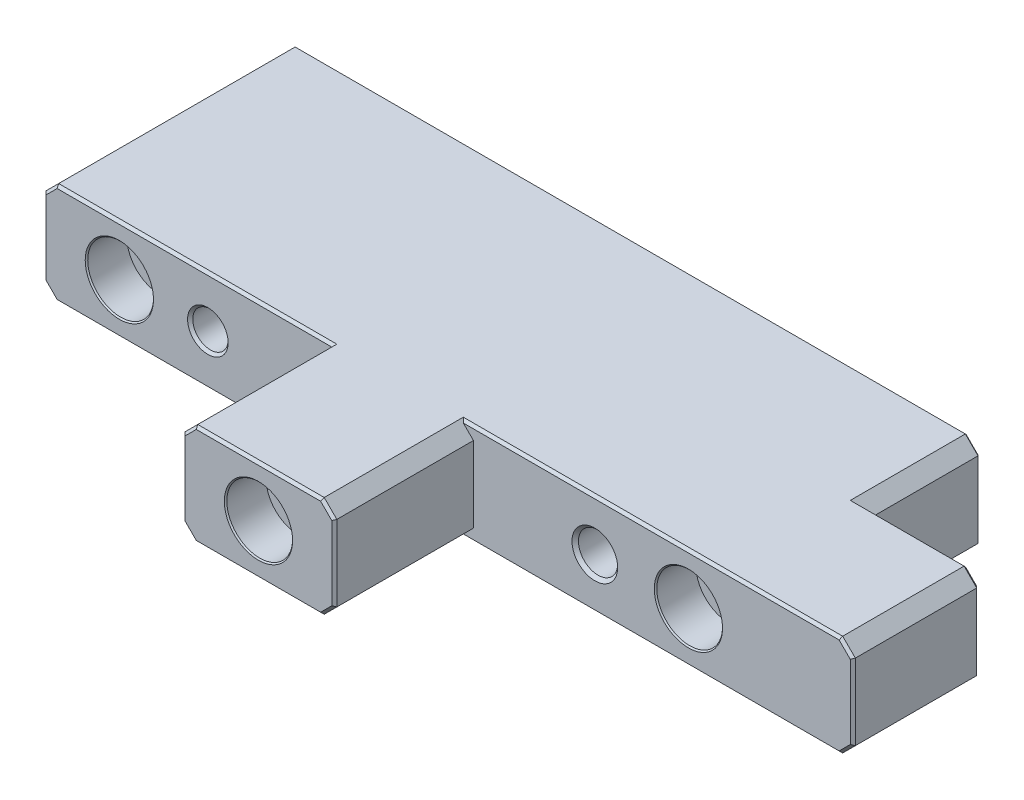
ISO-10303-21;
HEADER;
FILE_DESCRIPTION(('STEP AP214'),'2;1');
FILE_NAME('part.step','',(''),(''),'','','');
FILE_SCHEMA(('AUTOMOTIVE_DESIGN { 1 0 10303 214 1 1 1 1 }'));
ENDSEC;
DATA;
#1=APPLICATION_CONTEXT('core data for automotive mechanical design processes');
#2=APPLICATION_PROTOCOL_DEFINITION('international standard','automotive_design',2000,#1);
#3=PRODUCT_CONTEXT('',#1,'mechanical');
#4=PRODUCT('Part','Part','',(#3));
#5=PRODUCT_RELATED_PRODUCT_CATEGORY('part','',(#4));
#6=PRODUCT_DEFINITION_FORMATION('','',#4);
#7=PRODUCT_DEFINITION_CONTEXT('part definition',#1,'design');
#8=PRODUCT_DEFINITION('design','',#6,#7);
#9=PRODUCT_DEFINITION_SHAPE('','',#8);
#10=(LENGTH_UNIT() NAMED_UNIT(*) SI_UNIT(.MILLI.,.METRE.));
#11=(NAMED_UNIT(*) PLANE_ANGLE_UNIT() SI_UNIT($,.RADIAN.));
#12=(NAMED_UNIT(*) SI_UNIT($,.STERADIAN.) SOLID_ANGLE_UNIT());
#13=UNCERTAINTY_MEASURE_WITH_UNIT(LENGTH_MEASURE(1.E-05),#10,'distance_accuracy_value','');
#14=(GEOMETRIC_REPRESENTATION_CONTEXT(3) GLOBAL_UNCERTAINTY_ASSIGNED_CONTEXT((#13)) GLOBAL_UNIT_ASSIGNED_CONTEXT((#10,
#11,#12)) REPRESENTATION_CONTEXT('',''));
#15=CARTESIAN_POINT('',(0.,0.,0.));
#16=DIRECTION('',(0.,0.,1.));
#17=DIRECTION('',(1.,0.,0.));
#18=AXIS2_PLACEMENT_3D('',#15,#16,#17);
#19=CARTESIAN_POINT('',(320.,40.,150.));
#20=DIRECTION('',(0.,-1.,0.));
#21=DIRECTION('',(1.,0.,0.));
#22=AXIS2_PLACEMENT_3D('',#19,#20,#21);
#23=PLANE('',#22);
#24=DIRECTION('',(0.,0.,-1.));
#25=VECTOR('',#24,1.);
#26=CARTESIAN_POINT('',(270.,40.,150.));
#27=LINE('',#26,#25);
#28=CARTESIAN_POINT('',(270.,40.,45.9999999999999));
#29=VERTEX_POINT('',#28);
#30=CARTESIAN_POINT('',(270.,40.,0.500000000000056));
#31=VERTEX_POINT('',#30);
#32=EDGE_CURVE('E360',#29,#31,#27,.T.);
#33=ORIENTED_EDGE('',*,*,#32,.T.);
#34=DIRECTION('',(-1.,0.,0.));
#35=VECTOR('',#34,1.);
#36=CARTESIAN_POINT('',(320.,40.,0.500000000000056));
#37=LINE('',#36,#35);
#38=CARTESIAN_POINT('',(5.,40.,0.500000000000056));
#39=VERTEX_POINT('',#38);
#40=EDGE_CURVE('E614',#31,#39,#37,.T.);
#41=ORIENTED_EDGE('',*,*,#40,.T.);
#42=DIRECTION('',(0.,0.,1.));
#43=VECTOR('',#42,1.);
#44=CARTESIAN_POINT('',(5.,40.,150.));
#45=LINE('',#44,#43);
#46=CARTESIAN_POINT('',(5.,40.,94.0000000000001));
#47=VERTEX_POINT('',#46);
#48=EDGE_CURVE('E353',#39,#47,#45,.T.);
#49=ORIENTED_EDGE('',*,*,#48,.T.);
#50=DIRECTION('',(1.,0.,0.));
#51=VECTOR('',#50,1.);
#52=CARTESIAN_POINT('',(320.,40.,94.0000000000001));
#53=LINE('',#52,#51);
#54=CARTESIAN_POINT('',(115.,40.,94.0000000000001));
#55=VERTEX_POINT('',#54);
#56=EDGE_CURVE('E431',#47,#55,#53,.T.);
#57=ORIENTED_EDGE('',*,*,#56,.T.);
#58=DIRECTION('',(0.,0.,1.));
#59=VECTOR('',#58,1.);
#60=CARTESIAN_POINT('',(115.,40.,150.));
#61=LINE('',#60,#59);
#62=CARTESIAN_POINT('',(115.,40.,149.));
#63=VERTEX_POINT('',#62);
#64=EDGE_CURVE('E363',#55,#63,#61,.T.);
#65=ORIENTED_EDGE('',*,*,#64,.T.);
#66=DIRECTION('',(1.,0.,0.));
#67=VECTOR('',#66,1.);
#68=CARTESIAN_POINT('',(165.,40.,149.));
#69=LINE('',#68,#67);
#70=CARTESIAN_POINT('',(165.,40.,149.));
#71=VERTEX_POINT('',#70);
#72=EDGE_CURVE('E424',#63,#71,#69,.T.);
#73=ORIENTED_EDGE('',*,*,#72,.T.);
#74=DIRECTION('',(0.,0.,-1.));
#75=VECTOR('',#74,1.);
#76=CARTESIAN_POINT('',(165.,40.,150.));
#77=LINE('',#76,#75);
#78=CARTESIAN_POINT('',(165.,40.,94.0000000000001));
#79=VERTEX_POINT('',#78);
#80=EDGE_CURVE('E355',#71,#79,#77,.T.);
#81=ORIENTED_EDGE('',*,*,#80,.T.);
#82=DIRECTION('',(1.,0.,0.));
#83=VECTOR('',#82,1.);
#84=CARTESIAN_POINT('',(320.,40.,94.0000000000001));
#85=LINE('',#84,#83);
#86=CARTESIAN_POINT('',(315.,40.,94.0000000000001));
#87=VERTEX_POINT('',#86);
#88=EDGE_CURVE('E426',#79,#87,#85,.T.);
#89=ORIENTED_EDGE('',*,*,#88,.T.);
#90=DIRECTION('',(0.,0.,-1.));
#91=VECTOR('',#90,1.);
#92=CARTESIAN_POINT('',(315.,40.,150.));
#93=LINE('',#92,#91);
#94=CARTESIAN_POINT('',(315.,40.,46.));
#95=VERTEX_POINT('',#94);
#96=EDGE_CURVE('E357',#87,#95,#93,.T.);
#97=ORIENTED_EDGE('',*,*,#96,.T.);
#98=DIRECTION('',(-1.,0.,0.));
#99=VECTOR('',#98,1.);
#100=CARTESIAN_POINT('',(320.,40.,45.9999999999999));
#101=LINE('',#100,#99);
#102=EDGE_CURVE('E428',#95,#29,#101,.T.);
#103=ORIENTED_EDGE('',*,*,#102,.T.);
#104=EDGE_LOOP('',(#33,#41,#49,#57,#65,#73,#81,#89,#97,#103));
#105=FACE_BOUND('',#104,.T.);
#106=ADVANCED_FACE('F36',(#105),#23,.F.);
#107=CARTESIAN_POINT('',(0.,40.,150.));
#108=DIRECTION('',(1.,0.,0.));
#109=DIRECTION('',(0.,0.,-1.));
#110=AXIS2_PLACEMENT_3D('',#107,#108,#109);
#111=PLANE('',#110);
#112=DIRECTION('',(0.,0.,-1.));
#113=VECTOR('',#112,1.);
#114=CARTESIAN_POINT('',(0.,35.,150.));
#115=LINE('',#114,#113);
#116=CARTESIAN_POINT('',(0.,35.,94.0000000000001));
#117=VERTEX_POINT('',#116);
#118=CARTESIAN_POINT('',(0.,35.,0.500000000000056));
#119=VERTEX_POINT('',#118);
#120=EDGE_CURVE('E393',#117,#119,#115,.T.);
#121=ORIENTED_EDGE('',*,*,#120,.T.);
#122=DIRECTION('',(0.,-1.,0.));
#123=VECTOR('',#122,1.);
#124=CARTESIAN_POINT('',(0.,40.,0.500000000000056));
#125=LINE('',#124,#123);
#126=CARTESIAN_POINT('',(0.,5.,0.500000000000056));
#127=VERTEX_POINT('',#126);
#128=EDGE_CURVE('E618',#119,#127,#125,.T.);
#129=ORIENTED_EDGE('',*,*,#128,.T.);
#130=DIRECTION('',(0.,0.,1.));
#131=VECTOR('',#130,1.);
#132=CARTESIAN_POINT('',(0.,5.,150.));
#133=LINE('',#132,#131);
#134=CARTESIAN_POINT('',(0.,5.,94.0000000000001));
#135=VERTEX_POINT('',#134);
#136=EDGE_CURVE('E396',#127,#135,#133,.T.);
#137=ORIENTED_EDGE('',*,*,#136,.T.);
#138=DIRECTION('',(0.,1.,0.));
#139=VECTOR('',#138,1.);
#140=CARTESIAN_POINT('',(0.,40.,94.0000000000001));
#141=LINE('',#140,#139);
#142=EDGE_CURVE('E437',#135,#117,#141,.T.);
#143=ORIENTED_EDGE('',*,*,#142,.T.);
#144=EDGE_LOOP('',(#121,#129,#137,#143));
#145=FACE_BOUND('',#144,.T.);
#146=ADVANCED_FACE('F705',(#145),#111,.F.);
#147=CARTESIAN_POINT('',(0.,0.,150.));
#148=DIRECTION('',(0.,1.,0.));
#149=DIRECTION('',(0.,0.,1.));
#150=AXIS2_PLACEMENT_3D('',#147,#148,#149);
#151=PLANE('',#150);
#152=CARTESIAN_POINT('',(300.,0.,70.));
#153=DIRECTION('',(0.,-1.,0.));
#154=DIRECTION('',(0.,0.,-1.));
#155=AXIS2_PLACEMENT_3D('',#152,#153,#154);
#156=CIRCLE('',#155,8.025);
#157=CARTESIAN_POINT('',(300.,0.,61.975));
#158=VERTEX_POINT('',#157);
#159=EDGE_CURVE('E303',#158,#158,#156,.T.);
#160=ORIENTED_EDGE('',*,*,#159,.F.);
#161=EDGE_LOOP('',(#160));
#162=FACE_BOUND('',#161,.T.);
#163=DIRECTION('',(0.,0.,-1.));
#164=VECTOR('',#163,1.);
#165=CARTESIAN_POINT('',(5.,0.,150.));
#166=LINE('',#165,#164);
#167=CARTESIAN_POINT('',(5.,0.,94.0000000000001));
#168=VERTEX_POINT('',#167);
#169=CARTESIAN_POINT('',(5.,0.,0.500000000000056));
#170=VERTEX_POINT('',#169);
#171=EDGE_CURVE('E366',#168,#170,#166,.T.);
#172=ORIENTED_EDGE('',*,*,#171,.T.);
#173=DIRECTION('',(1.,0.,0.));
#174=VECTOR('',#173,1.);
#175=CARTESIAN_POINT('',(0.,0.,0.500000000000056));
#176=LINE('',#175,#174);
#177=CARTESIAN_POINT('',(270.,0.,0.500000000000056));
#178=VERTEX_POINT('',#177);
#179=EDGE_CURVE('E61',#170,#178,#176,.T.);
#180=ORIENTED_EDGE('',*,*,#179,.T.);
#181=DIRECTION('',(0.,0.,1.));
#182=VECTOR('',#181,1.);
#183=CARTESIAN_POINT('',(270.,0.,150.));
#184=LINE('',#183,#182);
#185=CARTESIAN_POINT('',(270.,0.,45.9999999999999));
#186=VERTEX_POINT('',#185);
#187=EDGE_CURVE('E374',#178,#186,#184,.T.);
#188=ORIENTED_EDGE('',*,*,#187,.T.);
#189=DIRECTION('',(1.,0.,0.));
#190=VECTOR('',#189,1.);
#191=CARTESIAN_POINT('',(0.,0.,45.9999999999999));
#192=LINE('',#191,#190);
#193=CARTESIAN_POINT('',(315.,0.,46.));
#194=VERTEX_POINT('',#193);
#195=EDGE_CURVE('E447',#186,#194,#192,.T.);
#196=ORIENTED_EDGE('',*,*,#195,.T.);
#197=DIRECTION('',(0.,0.,1.));
#198=VECTOR('',#197,1.);
#199=CARTESIAN_POINT('',(315.,0.,150.));
#200=LINE('',#199,#198);
#201=CARTESIAN_POINT('',(315.,0.,94.0000000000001));
#202=VERTEX_POINT('',#201);
#203=EDGE_CURVE('E371',#194,#202,#200,.T.);
#204=ORIENTED_EDGE('',*,*,#203,.T.);
#205=DIRECTION('',(-1.,0.,0.));
#206=VECTOR('',#205,1.);
#207=CARTESIAN_POINT('',(0.,0.,94.0000000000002));
#208=LINE('',#207,#206);
#209=CARTESIAN_POINT('',(165.,0.,94.0000000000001));
#210=VERTEX_POINT('',#209);
#211=EDGE_CURVE('E444',#202,#210,#208,.T.);
#212=ORIENTED_EDGE('',*,*,#211,.T.);
#213=DIRECTION('',(0.,0.,1.));
#214=VECTOR('',#213,1.);
#215=CARTESIAN_POINT('',(165.,0.,150.));
#216=LINE('',#215,#214);
#217=CARTESIAN_POINT('',(165.,0.,149.));
#218=VERTEX_POINT('',#217);
#219=EDGE_CURVE('E368',#210,#218,#216,.T.);
#220=ORIENTED_EDGE('',*,*,#219,.T.);
#221=DIRECTION('',(-1.,0.,0.));
#222=VECTOR('',#221,1.);
#223=CARTESIAN_POINT('',(115.,0.,149.));
#224=LINE('',#223,#222);
#225=CARTESIAN_POINT('',(115.,0.,149.));
#226=VERTEX_POINT('',#225);
#227=EDGE_CURVE('E442',#218,#226,#224,.T.);
#228=ORIENTED_EDGE('',*,*,#227,.T.);
#229=DIRECTION('',(0.,0.,-1.));
#230=VECTOR('',#229,1.);
#231=CARTESIAN_POINT('',(115.,0.,150.));
#232=LINE('',#231,#230);
#233=CARTESIAN_POINT('',(115.,0.,94.0000000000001));
#234=VERTEX_POINT('',#233);
#235=EDGE_CURVE('E376',#226,#234,#232,.T.);
#236=ORIENTED_EDGE('',*,*,#235,.T.);
#237=DIRECTION('',(-1.,0.,0.));
#238=VECTOR('',#237,1.);
#239=CARTESIAN_POINT('',(0.,0.,94.0000000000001));
#240=LINE('',#239,#238);
#241=EDGE_CURVE('E450',#234,#168,#240,.T.);
#242=ORIENTED_EDGE('',*,*,#241,.T.);
#243=EDGE_LOOP('',(#172,#180,#188,#196,#204,#212,#220,#228,#236,#242));
#244=FACE_BOUND('',#243,.T.);
#245=ADVANCED_FACE('F685',(#162,#244),#151,.F.);
#246=CARTESIAN_POINT('',(320.,0.,150.));
#247=DIRECTION('',(-1.,0.,0.));
#248=DIRECTION('',(0.,-1.,0.));
#249=AXIS2_PLACEMENT_3D('',#246,#247,#248);
#250=PLANE('',#249);
#251=DIRECTION('',(0.,0.,-1.));
#252=VECTOR('',#251,1.);
#253=CARTESIAN_POINT('',(320.,4.99999999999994,150.));
#254=LINE('',#253,#252);
#255=CARTESIAN_POINT('',(320.,4.99999999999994,94.0000000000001));
#256=VERTEX_POINT('',#255);
#257=CARTESIAN_POINT('',(320.,4.99999999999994,45.9999999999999));
#258=VERTEX_POINT('',#257);
#259=EDGE_CURVE('E385',#256,#258,#254,.T.);
#260=ORIENTED_EDGE('',*,*,#259,.T.);
#261=DIRECTION('',(0.,1.,0.));
#262=VECTOR('',#261,1.);
#263=CARTESIAN_POINT('',(320.,0.,45.9999999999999));
#264=LINE('',#263,#262);
#265=CARTESIAN_POINT('',(320.,35.,46.));
#266=VERTEX_POINT('',#265);
#267=EDGE_CURVE('E468',#258,#266,#264,.T.);
#268=ORIENTED_EDGE('',*,*,#267,.T.);
#269=DIRECTION('',(0.,0.,1.));
#270=VECTOR('',#269,1.);
#271=CARTESIAN_POINT('',(320.,35.,150.));
#272=LINE('',#271,#270);
#273=CARTESIAN_POINT('',(320.,35.,94.0000000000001));
#274=VERTEX_POINT('',#273);
#275=EDGE_CURVE('E382',#266,#274,#272,.T.);
#276=ORIENTED_EDGE('',*,*,#275,.T.);
#277=DIRECTION('',(0.,-1.,0.));
#278=VECTOR('',#277,1.);
#279=CARTESIAN_POINT('',(320.,0.,94.0000000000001));
#280=LINE('',#279,#278);
#281=EDGE_CURVE('E466',#274,#256,#280,.T.);
#282=ORIENTED_EDGE('',*,*,#281,.T.);
#283=EDGE_LOOP('',(#260,#268,#276,#282));
#284=FACE_BOUND('',#283,.T.);
#285=ADVANCED_FACE('F974',(#284),#250,.F.);
#286=CARTESIAN_POINT('',(0.,40.,150.));
#287=DIRECTION('',(0.,0.,1.));
#288=DIRECTION('',(1.,0.,0.));
#289=AXIS2_PLACEMENT_3D('',#286,#287,#288);
#290=PLANE('',#289);
#291=CARTESIAN_POINT('',(140.,20.,150.));
#292=DIRECTION('',(0.,0.,1.));
#293=DIRECTION('',(1.,0.,0.));
#294=AXIS2_PLACEMENT_3D('',#291,#292,#293);
#295=CIRCLE('',#294,13.5);
#296=CARTESIAN_POINT('',(153.5,20.,150.));
#297=VERTEX_POINT('',#296);
#298=EDGE_CURVE('E11',#297,#297,#295,.F.);
#299=ORIENTED_EDGE('',*,*,#298,.T.);
#300=EDGE_LOOP('',(#299));
#301=FACE_BOUND('',#300,.T.);
#302=DIRECTION('',(0.,-1.,0.));
#303=VECTOR('',#302,1.);
#304=CARTESIAN_POINT('',(111.,5.00000000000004,150.));
#305=LINE('',#304,#303);
#306=CARTESIAN_POINT('',(111.,34.5857864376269,150.));
#307=VERTEX_POINT('',#306);
#308=CARTESIAN_POINT('',(111.,5.41421356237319,150.));
#309=VERTEX_POINT('',#308);
#310=EDGE_CURVE('E496',#307,#309,#305,.T.);
#311=ORIENTED_EDGE('',*,*,#310,.T.);
#312=DIRECTION('',(0.707106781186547,-0.707106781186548,0.));
#313=VECTOR('',#312,1.);
#314=CARTESIAN_POINT('',(38.2071067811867,78.2071067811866,150.));
#315=LINE('',#314,#313);
#316=CARTESIAN_POINT('',(115.414213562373,1.00000000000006,150.));
#317=VERTEX_POINT('',#316);
#318=EDGE_CURVE('E498',#309,#317,#315,.T.);
#319=ORIENTED_EDGE('',*,*,#318,.T.);
#320=DIRECTION('',(1.,0.,0.));
#321=VECTOR('',#320,1.);
#322=CARTESIAN_POINT('',(165.,1.00000000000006,150.));
#323=LINE('',#322,#321);
#324=CARTESIAN_POINT('',(164.585786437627,1.00000000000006,150.));
#325=VERTEX_POINT('',#324);
#326=EDGE_CURVE('E484',#317,#325,#323,.T.);
#327=ORIENTED_EDGE('',*,*,#326,.T.);
#328=DIRECTION('',(0.707106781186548,0.707106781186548,0.));
#329=VECTOR('',#328,1.);
#330=CARTESIAN_POINT('',(101.792893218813,-61.7928932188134,150.));
#331=LINE('',#330,#329);
#332=CARTESIAN_POINT('',(169.,5.41421356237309,150.));
#333=VERTEX_POINT('',#332);
#334=EDGE_CURVE('E486',#325,#333,#331,.T.);
#335=ORIENTED_EDGE('',*,*,#334,.T.);
#336=DIRECTION('',(0.,1.,0.));
#337=VECTOR('',#336,1.);
#338=CARTESIAN_POINT('',(169.,35.,150.));
#339=LINE('',#338,#337);
#340=CARTESIAN_POINT('',(169.,34.5857864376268,150.));
#341=VERTEX_POINT('',#340);
#342=EDGE_CURVE('E488',#333,#341,#339,.T.);
#343=ORIENTED_EDGE('',*,*,#342,.T.);
#344=DIRECTION('',(-0.707106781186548,0.707106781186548,0.));
#345=VECTOR('',#344,1.);
#346=CARTESIAN_POINT('',(81.7928932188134,121.792893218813,150.));
#347=LINE('',#346,#345);
#348=CARTESIAN_POINT('',(164.585786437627,38.9999999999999,150.));
#349=VERTEX_POINT('',#348);
#350=EDGE_CURVE('E490',#341,#349,#347,.T.);
#351=ORIENTED_EDGE('',*,*,#350,.T.);
#352=DIRECTION('',(-1.,0.,0.));
#353=VECTOR('',#352,1.);
#354=CARTESIAN_POINT('',(115.,38.9999999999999,150.));
#355=LINE('',#354,#353);
#356=CARTESIAN_POINT('',(115.414213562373,38.9999999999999,150.));
#357=VERTEX_POINT('',#356);
#358=EDGE_CURVE('E492',#349,#357,#355,.T.);
#359=ORIENTED_EDGE('',*,*,#358,.T.);
#360=DIRECTION('',(-0.707106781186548,-0.707106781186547,0.));
#361=VECTOR('',#360,1.);
#362=CARTESIAN_POINT('',(58.2071067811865,-18.2071067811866,150.));
#363=LINE('',#362,#361);
#364=EDGE_CURVE('E494',#357,#307,#363,.T.);
#365=ORIENTED_EDGE('',*,*,#364,.T.);
#366=EDGE_LOOP('',(#311,#319,#327,#335,#343,#351,#359,#365));
#367=FACE_BOUND('',#366,.T.);
#368=ADVANCED_FACE('F929',(#301,#367),#290,.T.);
#369=CARTESIAN_POINT('',(0.,40.,0.));
#370=DIRECTION('',(0.,0.,1.));
#371=DIRECTION('',(1.,0.,0.));
#372=AXIS2_PLACEMENT_3D('',#369,#370,#371);
#373=PLANE('',#372);
#374=DIRECTION('',(1.,0.,0.));
#375=VECTOR('',#374,1.);
#376=CARTESIAN_POINT('',(0.,39.4999999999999,0.));
#377=LINE('',#376,#375);
#378=CARTESIAN_POINT('',(5.20710678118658,39.4999999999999,0.));
#379=VERTEX_POINT('',#378);
#380=CARTESIAN_POINT('',(269.792893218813,39.4999999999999,0.));
#381=VERTEX_POINT('',#380);
#382=EDGE_CURVE('E606',#379,#381,#377,.T.);
#383=ORIENTED_EDGE('',*,*,#382,.T.);
#384=DIRECTION('',(0.707106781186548,-0.707106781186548,0.));
#385=VECTOR('',#384,1.);
#386=CARTESIAN_POINT('',(274.646446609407,34.6464466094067,0.));
#387=LINE('',#386,#385);
#388=CARTESIAN_POINT('',(274.5,34.7928932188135,0.));
#389=VERTEX_POINT('',#388);
#390=EDGE_CURVE('E608',#381,#389,#387,.T.);
#391=ORIENTED_EDGE('',*,*,#390,.T.);
#392=DIRECTION('',(0.,-1.,0.));
#393=VECTOR('',#392,1.);
#394=CARTESIAN_POINT('',(274.5,40.,0.));
#395=LINE('',#394,#393);
#396=CARTESIAN_POINT('',(274.5,5.2071067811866,0.));
#397=VERTEX_POINT('',#396);
#398=EDGE_CURVE('E594',#389,#397,#395,.T.);
#399=ORIENTED_EDGE('',*,*,#398,.T.);
#400=DIRECTION('',(-0.707106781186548,-0.707106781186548,0.));
#401=VECTOR('',#400,1.);
#402=CARTESIAN_POINT('',(269.646446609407,0.353553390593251,0.));
#403=LINE('',#402,#401);
#404=CARTESIAN_POINT('',(269.792893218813,0.500000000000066,0.));
#405=VERTEX_POINT('',#404);
#406=EDGE_CURVE('E596',#397,#405,#403,.T.);
#407=ORIENTED_EDGE('',*,*,#406,.T.);
#408=DIRECTION('',(-1.,0.,0.));
#409=VECTOR('',#408,1.);
#410=CARTESIAN_POINT('',(0.,0.500000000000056,0.));
#411=LINE('',#410,#409);
#412=CARTESIAN_POINT('',(5.20710678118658,0.500000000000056,0.));
#413=VERTEX_POINT('',#412);
#414=EDGE_CURVE('E598',#405,#413,#411,.T.);
#415=ORIENTED_EDGE('',*,*,#414,.T.);
#416=DIRECTION('',(-0.707106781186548,0.707106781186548,0.));
#417=VECTOR('',#416,1.);
#418=CARTESIAN_POINT('',(0.353553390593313,5.35355339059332,0.));
#419=LINE('',#418,#417);
#420=CARTESIAN_POINT('',(0.500000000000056,5.20710678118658,0.));
#421=VERTEX_POINT('',#420);
#422=EDGE_CURVE('E600',#413,#421,#419,.T.);
#423=ORIENTED_EDGE('',*,*,#422,.T.);
#424=DIRECTION('',(0.,1.,0.));
#425=VECTOR('',#424,1.);
#426=CARTESIAN_POINT('',(0.500000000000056,40.,0.));
#427=LINE('',#426,#425);
#428=CARTESIAN_POINT('',(0.500000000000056,34.7928932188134,0.));
#429=VERTEX_POINT('',#428);
#430=EDGE_CURVE('E602',#421,#429,#427,.T.);
#431=ORIENTED_EDGE('',*,*,#430,.T.);
#432=DIRECTION('',(0.707106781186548,0.707106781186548,0.));
#433=VECTOR('',#432,1.);
#434=CARTESIAN_POINT('',(5.35355339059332,39.6464466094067,0.));
#435=LINE('',#434,#433);
#436=EDGE_CURVE('E604',#429,#379,#435,.T.);
#437=ORIENTED_EDGE('',*,*,#436,.T.);
#438=EDGE_LOOP('',(#383,#391,#399,#407,#415,#423,#431,#437));
#439=FACE_BOUND('',#438,.T.);
#440=CARTESIAN_POINT('',(30.,20.,0.));
#441=DIRECTION('',(0.,0.,1.));
#442=DIRECTION('',(1.,0.,0.));
#443=AXIS2_PLACEMENT_3D('',#440,#441,#442);
#444=CIRCLE('',#443,9.25000000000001);
#445=CARTESIAN_POINT('',(39.25,20.,0.));
#446=VERTEX_POINT('',#445);
#447=EDGE_CURVE('E591',#446,#446,#444,.T.);
#448=ORIENTED_EDGE('',*,*,#447,.T.);
#449=EDGE_LOOP('',(#448));
#450=FACE_BOUND('',#449,.T.);
#451=CARTESIAN_POINT('',(255.,20.,0.));
#452=DIRECTION('',(0.,0.,1.));
#453=DIRECTION('',(1.,0.,0.));
#454=AXIS2_PLACEMENT_3D('',#451,#452,#453);
#455=CIRCLE('',#454,9.25000000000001);
#456=CARTESIAN_POINT('',(264.25,20.,0.));
#457=VERTEX_POINT('',#456);
#458=EDGE_CURVE('E588',#457,#457,#455,.T.);
#459=ORIENTED_EDGE('',*,*,#458,.T.);
#460=EDGE_LOOP('',(#459));
#461=FACE_BOUND('',#460,.T.);
#462=CARTESIAN_POINT('',(140.,20.,0.));
#463=DIRECTION('',(0.,0.,1.));
#464=DIRECTION('',(1.,0.,0.));
#465=AXIS2_PLACEMENT_3D('',#462,#463,#464);
#466=CIRCLE('',#465,9.24999999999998);
#467=CARTESIAN_POINT('',(149.25,20.,0.));
#468=VERTEX_POINT('',#467);
#469=EDGE_CURVE('E529',#468,#468,#466,.T.);
#470=ORIENTED_EDGE('',*,*,#469,.T.);
#471=EDGE_LOOP('',(#470));
#472=FACE_BOUND('',#471,.T.);
#473=ADVANCED_FACE('F722',(#439,#450,#461,#472),#373,.F.);
#474=CARTESIAN_POINT('',(340.,0.,95.));
#475=DIRECTION('',(0.,0.,-1.));
#476=DIRECTION('',(-1.,0.,0.));
#477=AXIS2_PLACEMENT_3D('',#474,#475,#476);
#478=PLANE('',#477);
#479=CARTESIAN_POINT('',(255.,20.,95.));
#480=DIRECTION('',(0.,0.,-1.));
#481=DIRECTION('',(-1.,0.,0.));
#482=AXIS2_PLACEMENT_3D('',#479,#480,#481);
#483=CIRCLE('',#482,13.5);
#484=CARTESIAN_POINT('',(241.5,20.,95.));
#485=VERTEX_POINT('',#484);
#486=EDGE_CURVE('E644',#485,#485,#483,.T.);
#487=ORIENTED_EDGE('',*,*,#486,.T.);
#488=EDGE_LOOP('',(#487));
#489=FACE_BOUND('',#488,.T.);
#490=CARTESIAN_POINT('',(218.,20.,95.0000000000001));
#491=DIRECTION('',(0.,0.,1.));
#492=DIRECTION('',(0.,-1.,0.));
#493=AXIS2_PLACEMENT_3D('',#490,#491,#492);
#494=CIRCLE('',#493,9.02500000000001);
#495=CARTESIAN_POINT('',(218.,10.975,95.0000000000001));
#496=VERTEX_POINT('',#495);
#497=EDGE_CURVE('E312',#496,#496,#494,.T.);
#498=ORIENTED_EDGE('',*,*,#497,.F.);
#499=EDGE_LOOP('',(#498));
#500=FACE_BOUND('',#499,.T.);
#501=DIRECTION('',(0.707106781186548,0.707106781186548,0.));
#502=VECTOR('',#501,1.);
#503=CARTESIAN_POINT('',(252.5,87.5,95.));
#504=LINE('',#503,#502);
#505=CARTESIAN_POINT('',(170.,4.99999999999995,95.));
#506=VERTEX_POINT('',#505);
#507=CARTESIAN_POINT('',(166.,0.999999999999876,95.));
#508=VERTEX_POINT('',#507);
#509=EDGE_CURVE('E410',#506,#508,#504,.F.);
#510=ORIENTED_EDGE('',*,*,#509,.T.);
#511=DIRECTION('',(1.,0.,0.));
#512=VECTOR('',#511,1.);
#513=CARTESIAN_POINT('',(340.,0.99999999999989,95.));
#514=LINE('',#513,#512);
#515=CARTESIAN_POINT('',(314.585786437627,0.999999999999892,95.));
#516=VERTEX_POINT('',#515);
#517=EDGE_CURVE('E482',#508,#516,#514,.T.);
#518=ORIENTED_EDGE('',*,*,#517,.T.);
#519=DIRECTION('',(0.707106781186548,0.707106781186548,0.));
#520=VECTOR('',#519,1.);
#521=CARTESIAN_POINT('',(319.292893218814,5.70710678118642,95.));
#522=LINE('',#521,#520);
#523=CARTESIAN_POINT('',(319.,5.41421356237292,95.));
#524=VERTEX_POINT('',#523);
#525=EDGE_CURVE('E480',#516,#524,#522,.T.);
#526=ORIENTED_EDGE('',*,*,#525,.T.);
#527=DIRECTION('',(0.,1.,0.));
#528=VECTOR('',#527,1.);
#529=CARTESIAN_POINT('',(319.,0.,95.));
#530=LINE('',#529,#528);
#531=CARTESIAN_POINT('',(319.,34.5857864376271,95.));
#532=VERTEX_POINT('',#531);
#533=EDGE_CURVE('E478',#524,#532,#530,.T.);
#534=ORIENTED_EDGE('',*,*,#533,.T.);
#535=DIRECTION('',(-0.707106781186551,0.707106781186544,0.));
#536=VECTOR('',#535,1.);
#537=CARTESIAN_POINT('',(314.292893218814,39.2928932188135,95.));
#538=LINE('',#537,#536);
#539=CARTESIAN_POINT('',(314.585786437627,39.0000000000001,95.));
#540=VERTEX_POINT('',#539);
#541=EDGE_CURVE('E476',#532,#540,#538,.T.);
#542=ORIENTED_EDGE('',*,*,#541,.T.);
#543=DIRECTION('',(-1.,0.,0.));
#544=VECTOR('',#543,1.);
#545=CARTESIAN_POINT('',(340.,39.0000000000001,95.));
#546=LINE('',#545,#544);
#547=CARTESIAN_POINT('',(166.,39.0000000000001,95.));
#548=VERTEX_POINT('',#547);
#549=EDGE_CURVE('E474',#540,#548,#546,.T.);
#550=ORIENTED_EDGE('',*,*,#549,.T.);
#551=DIRECTION('',(-0.707106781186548,0.707106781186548,0.));
#552=VECTOR('',#551,1.);
#553=CARTESIAN_POINT('',(272.5,-67.5,95.));
#554=LINE('',#553,#552);
#555=CARTESIAN_POINT('',(170.,35.,95.));
#556=VERTEX_POINT('',#555);
#557=EDGE_CURVE('E408',#548,#556,#554,.F.);
#558=ORIENTED_EDGE('',*,*,#557,.T.);
#559=DIRECTION('',(0.,1.,0.));
#560=VECTOR('',#559,1.);
#561=CARTESIAN_POINT('',(170.,0.,95.));
#562=LINE('',#561,#560);
#563=EDGE_CURVE('E345',#506,#556,#562,.T.);
#564=ORIENTED_EDGE('',*,*,#563,.F.);
#565=EDGE_LOOP('',(#510,#518,#526,#534,#542,#550,#558,#564));
#566=FACE_BOUND('',#565,.T.);
#567=ADVANCED_FACE('F903',(#489,#500,#566),#478,.F.);
#568=CARTESIAN_POINT('',(170.,0.,170.));
#569=DIRECTION('',(-1.,0.,0.));
#570=DIRECTION('',(0.,-1.,0.));
#571=AXIS2_PLACEMENT_3D('',#568,#569,#570);
#572=PLANE('',#571);
#573=DIRECTION('',(0.,0.,1.));
#574=VECTOR('',#573,1.);
#575=CARTESIAN_POINT('',(170.,35.,170.));
#576=LINE('',#575,#574);
#577=CARTESIAN_POINT('',(170.,35.,149.));
#578=VERTEX_POINT('',#577);
#579=EDGE_CURVE('E390',#556,#578,#576,.T.);
#580=ORIENTED_EDGE('',*,*,#579,.T.);
#581=DIRECTION('',(0.,-1.,0.));
#582=VECTOR('',#581,1.);
#583=CARTESIAN_POINT('',(170.,4.99999999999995,149.));
#584=LINE('',#583,#582);
#585=CARTESIAN_POINT('',(170.,4.99999999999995,149.));
#586=VERTEX_POINT('',#585);
#587=EDGE_CURVE('E510',#578,#586,#584,.T.);
#588=ORIENTED_EDGE('',*,*,#587,.T.);
#589=DIRECTION('',(0.,0.,-1.));
#590=VECTOR('',#589,1.);
#591=CARTESIAN_POINT('',(170.,4.99999999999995,170.));
#592=LINE('',#591,#590);
#593=EDGE_CURVE('E388',#586,#506,#592,.T.);
#594=ORIENTED_EDGE('',*,*,#593,.T.);
#595=ORIENTED_EDGE('',*,*,#563,.T.);
#596=EDGE_LOOP('',(#580,#588,#594,#595));
#597=FACE_BOUND('',#596,.T.);
#598=ADVANCED_FACE('F896',(#597),#572,.F.);
#599=CARTESIAN_POINT('',(-20.,0.,95.));
#600=DIRECTION('',(0.,0.,-1.));
#601=DIRECTION('',(-1.,0.,0.));
#602=AXIS2_PLACEMENT_3D('',#599,#600,#601);
#603=PLANE('',#602);
#604=CARTESIAN_POINT('',(30.,20.,95.));
#605=DIRECTION('',(0.,0.,-1.));
#606=DIRECTION('',(-1.,0.,0.));
#607=AXIS2_PLACEMENT_3D('',#604,#605,#606);
#608=CIRCLE('',#607,13.5);
#609=CARTESIAN_POINT('',(16.5,20.,95.));
#610=VERTEX_POINT('',#609);
#611=EDGE_CURVE('E638',#610,#610,#608,.T.);
#612=ORIENTED_EDGE('',*,*,#611,.T.);
#613=EDGE_LOOP('',(#612));
#614=FACE_BOUND('',#613,.T.);
#615=CARTESIAN_POINT('',(65.,20.,95.));
#616=DIRECTION('',(0.,0.,1.));
#617=DIRECTION('',(1.,0.,0.));
#618=AXIS2_PLACEMENT_3D('',#615,#616,#617);
#619=CIRCLE('',#618,8.025);
#620=CARTESIAN_POINT('',(73.025,20.,95.));
#621=VERTEX_POINT('',#620);
#622=EDGE_CURVE('E296',#621,#621,#619,.T.);
#623=ORIENTED_EDGE('',*,*,#622,.F.);
#624=EDGE_LOOP('',(#623));
#625=FACE_BOUND('',#624,.T.);
#626=DIRECTION('',(-0.707106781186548,-0.707106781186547,0.));
#627=VECTOR('',#626,1.);
#628=CARTESIAN_POINT('',(27.4999999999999,-47.5,95.));
#629=LINE('',#628,#627);
#630=CARTESIAN_POINT('',(110.,35.,95.));
#631=VERTEX_POINT('',#630);
#632=CARTESIAN_POINT('',(114.,39.0000000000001,95.));
#633=VERTEX_POINT('',#632);
#634=EDGE_CURVE('E398',#631,#633,#629,.F.);
#635=ORIENTED_EDGE('',*,*,#634,.T.);
#636=DIRECTION('',(-1.,0.,0.));
#637=VECTOR('',#636,1.);
#638=CARTESIAN_POINT('',(-20.,39.,95.));
#639=LINE('',#638,#637);
#640=CARTESIAN_POINT('',(5.41421356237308,39.,95.));
#641=VERTEX_POINT('',#640);
#642=EDGE_CURVE('E421',#633,#641,#639,.T.);
#643=ORIENTED_EDGE('',*,*,#642,.T.);
#644=DIRECTION('',(-0.707106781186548,-0.707106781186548,0.));
#645=VECTOR('',#644,1.);
#646=CARTESIAN_POINT('',(0.70710678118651,34.2928932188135,95.));
#647=LINE('',#646,#645);
#648=CARTESIAN_POINT('',(0.999999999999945,34.5857864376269,95.));
#649=VERTEX_POINT('',#648);
#650=EDGE_CURVE('E419',#641,#649,#647,.T.);
#651=ORIENTED_EDGE('',*,*,#650,.T.);
#652=DIRECTION('',(0.,-1.,0.));
#653=VECTOR('',#652,1.);
#654=CARTESIAN_POINT('',(0.999999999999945,0.,95.));
#655=LINE('',#654,#653);
#656=CARTESIAN_POINT('',(0.999999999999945,5.41421356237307,95.));
#657=VERTEX_POINT('',#656);
#658=EDGE_CURVE('E417',#649,#657,#655,.T.);
#659=ORIENTED_EDGE('',*,*,#658,.T.);
#660=DIRECTION('',(0.707106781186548,-0.707106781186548,0.));
#661=VECTOR('',#660,1.);
#662=CARTESIAN_POINT('',(5.70710678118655,0.707106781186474,95.));
#663=LINE('',#662,#661);
#664=CARTESIAN_POINT('',(5.41421356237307,0.999999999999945,95.));
#665=VERTEX_POINT('',#664);
#666=EDGE_CURVE('E415',#657,#665,#663,.T.);
#667=ORIENTED_EDGE('',*,*,#666,.T.);
#668=DIRECTION('',(1.,0.,0.));
#669=VECTOR('',#668,1.);
#670=CARTESIAN_POINT('',(-20.,0.999999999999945,95.));
#671=LINE('',#670,#669);
#672=CARTESIAN_POINT('',(114.,0.999999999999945,95.));
#673=VERTEX_POINT('',#672);
#674=EDGE_CURVE('E413',#665,#673,#671,.T.);
#675=ORIENTED_EDGE('',*,*,#674,.T.);
#676=DIRECTION('',(0.707106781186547,-0.707106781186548,0.));
#677=VECTOR('',#676,1.);
#678=CARTESIAN_POINT('',(47.5000000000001,67.5,95.));
#679=LINE('',#678,#677);
#680=CARTESIAN_POINT('',(110.,5.00000000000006,95.));
#681=VERTEX_POINT('',#680);
#682=EDGE_CURVE('E401',#673,#681,#679,.F.);
#683=ORIENTED_EDGE('',*,*,#682,.T.);
#684=DIRECTION('',(0.,1.,0.));
#685=VECTOR('',#684,1.);
#686=CARTESIAN_POINT('',(110.,0.,95.));
#687=LINE('',#686,#685);
#688=EDGE_CURVE('E342',#681,#631,#687,.T.);
#689=ORIENTED_EDGE('',*,*,#688,.T.);
#690=EDGE_LOOP('',(#635,#643,#651,#659,#667,#675,#683,#689));
#691=FACE_BOUND('',#690,.T.);
#692=ADVANCED_FACE('F949',(#614,#625,#691),#603,.F.);
#693=CARTESIAN_POINT('',(110.,0.,95.));
#694=DIRECTION('',(1.,0.,0.));
#695=DIRECTION('',(0.,0.,-1.));
#696=AXIS2_PLACEMENT_3D('',#693,#694,#695);
#697=PLANE('',#696);
#698=DIRECTION('',(0.,0.,1.));
#699=VECTOR('',#698,1.);
#700=CARTESIAN_POINT('',(110.,5.00000000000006,95.));
#701=LINE('',#700,#699);
#702=CARTESIAN_POINT('',(110.,5.00000000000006,149.));
#703=VERTEX_POINT('',#702);
#704=EDGE_CURVE('E348',#681,#703,#701,.T.);
#705=ORIENTED_EDGE('',*,*,#704,.T.);
#706=DIRECTION('',(0.,1.,0.));
#707=VECTOR('',#706,1.);
#708=CARTESIAN_POINT('',(110.,35.,149.));
#709=LINE('',#708,#707);
#710=CARTESIAN_POINT('',(110.,35.,149.));
#711=VERTEX_POINT('',#710);
#712=EDGE_CURVE('E504',#703,#711,#709,.T.);
#713=ORIENTED_EDGE('',*,*,#712,.T.);
#714=DIRECTION('',(0.,0.,-1.));
#715=VECTOR('',#714,1.);
#716=CARTESIAN_POINT('',(110.,35.,95.));
#717=LINE('',#716,#715);
#718=EDGE_CURVE('E351',#711,#631,#717,.T.);
#719=ORIENTED_EDGE('',*,*,#718,.T.);
#720=ORIENTED_EDGE('',*,*,#688,.F.);
#721=EDGE_LOOP('',(#705,#713,#719,#720));
#722=FACE_BOUND('',#721,.T.);
#723=ADVANCED_FACE('F943',(#722),#697,.F.);
#724=CARTESIAN_POINT('',(275.,0.,45.));
#725=DIRECTION('',(0.,0.,1.));
#726=DIRECTION('',(1.,0.,0.));
#727=AXIS2_PLACEMENT_3D('',#724,#725,#726);
#728=PLANE('',#727);
#729=DIRECTION('',(-0.707106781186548,-0.707106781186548,0.));
#730=VECTOR('',#729,1.);
#731=CARTESIAN_POINT('',(314.292893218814,0.707106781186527,45.));
#732=LINE('',#731,#730);
#733=CARTESIAN_POINT('',(319.,5.41421356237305,45.));
#734=VERTEX_POINT('',#733);
#735=CARTESIAN_POINT('',(314.585786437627,0.99999999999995,45.));
#736=VERTEX_POINT('',#735);
#737=EDGE_CURVE('E458',#734,#736,#732,.T.);
#738=ORIENTED_EDGE('',*,*,#737,.T.);
#739=DIRECTION('',(-1.,0.,0.));
#740=VECTOR('',#739,1.);
#741=CARTESIAN_POINT('',(275.,0.999999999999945,45.));
#742=LINE('',#741,#740);
#743=CARTESIAN_POINT('',(271.,0.999999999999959,45.));
#744=VERTEX_POINT('',#743);
#745=EDGE_CURVE('E460',#736,#744,#742,.T.);
#746=ORIENTED_EDGE('',*,*,#745,.T.);
#747=DIRECTION('',(-0.707106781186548,-0.707106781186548,0.));
#748=VECTOR('',#747,1.);
#749=CARTESIAN_POINT('',(272.5,2.50000000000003,45.));
#750=LINE('',#749,#748);
#751=CARTESIAN_POINT('',(275.,5.00000000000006,45.));
#752=VERTEX_POINT('',#751);
#753=EDGE_CURVE('E403',#744,#752,#750,.F.);
#754=ORIENTED_EDGE('',*,*,#753,.T.);
#755=DIRECTION('',(0.,1.,0.));
#756=VECTOR('',#755,1.);
#757=CARTESIAN_POINT('',(275.,0.,45.));
#758=LINE('',#757,#756);
#759=CARTESIAN_POINT('',(275.,35.,45.));
#760=VERTEX_POINT('',#759);
#761=EDGE_CURVE('E339',#752,#760,#758,.T.);
#762=ORIENTED_EDGE('',*,*,#761,.T.);
#763=DIRECTION('',(0.707106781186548,-0.707106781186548,0.));
#764=VECTOR('',#763,1.);
#765=CARTESIAN_POINT('',(292.5,17.5,45.));
#766=LINE('',#765,#764);
#767=CARTESIAN_POINT('',(271.,39.0000000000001,45.));
#768=VERTEX_POINT('',#767);
#769=EDGE_CURVE('E405',#760,#768,#766,.F.);
#770=ORIENTED_EDGE('',*,*,#769,.T.);
#771=DIRECTION('',(1.,0.,0.));
#772=VECTOR('',#771,1.);
#773=CARTESIAN_POINT('',(275.,39.0000000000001,45.));
#774=LINE('',#773,#772);
#775=CARTESIAN_POINT('',(314.585786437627,39.0000000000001,45.));
#776=VERTEX_POINT('',#775);
#777=EDGE_CURVE('E452',#768,#776,#774,.T.);
#778=ORIENTED_EDGE('',*,*,#777,.T.);
#779=DIRECTION('',(0.707106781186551,-0.707106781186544,0.));
#780=VECTOR('',#779,1.);
#781=CARTESIAN_POINT('',(319.292893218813,34.2928932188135,45.));
#782=LINE('',#781,#780);
#783=CARTESIAN_POINT('',(319.,34.5857864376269,45.));
#784=VERTEX_POINT('',#783);
#785=EDGE_CURVE('E454',#776,#784,#782,.T.);
#786=ORIENTED_EDGE('',*,*,#785,.T.);
#787=DIRECTION('',(0.,-1.,0.));
#788=VECTOR('',#787,1.);
#789=CARTESIAN_POINT('',(319.,0.,45.));
#790=LINE('',#789,#788);
#791=EDGE_CURVE('E456',#784,#734,#790,.T.);
#792=ORIENTED_EDGE('',*,*,#791,.T.);
#793=EDGE_LOOP('',(#738,#746,#754,#762,#770,#778,#786,#792));
#794=FACE_BOUND('',#793,.T.);
#795=ADVANCED_FACE('F956',(#794),#728,.F.);
#796=CARTESIAN_POINT('',(275.,0.,-25.));
#797=DIRECTION('',(-1.,0.,0.));
#798=DIRECTION('',(0.,-1.,0.));
#799=AXIS2_PLACEMENT_3D('',#796,#797,#798);
#800=PLANE('',#799);
#801=DIRECTION('',(0.,0.,-1.));
#802=VECTOR('',#801,1.);
#803=CARTESIAN_POINT('',(275.,5.00000000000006,-25.));
#804=LINE('',#803,#802);
#805=CARTESIAN_POINT('',(275.,5.00000000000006,0.500000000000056));
#806=VERTEX_POINT('',#805);
#807=EDGE_CURVE('E380',#752,#806,#804,.T.);
#808=ORIENTED_EDGE('',*,*,#807,.T.);
#809=DIRECTION('',(0.,1.,0.));
#810=VECTOR('',#809,1.);
#811=CARTESIAN_POINT('',(275.,0.,0.500000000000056));
#812=LINE('',#811,#810);
#813=CARTESIAN_POINT('',(275.,35.,0.500000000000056));
#814=VERTEX_POINT('',#813);
#815=EDGE_CURVE('E624',#806,#814,#812,.T.);
#816=ORIENTED_EDGE('',*,*,#815,.T.);
#817=DIRECTION('',(0.,0.,1.));
#818=VECTOR('',#817,1.);
#819=CARTESIAN_POINT('',(275.,35.,-25.));
#820=LINE('',#819,#818);
#821=EDGE_CURVE('E378',#814,#760,#820,.T.);
#822=ORIENTED_EDGE('',*,*,#821,.T.);
#823=ORIENTED_EDGE('',*,*,#761,.F.);
#824=EDGE_LOOP('',(#808,#816,#822,#823));
#825=FACE_BOUND('',#824,.T.);
#826=ADVANCED_FACE('F737',(#825),#800,.F.);
#827=CARTESIAN_POINT('',(30.,20.,95.0000000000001));
#828=DIRECTION('',(0.,0.,1.));
#829=DIRECTION('',(1.,0.,0.));
#830=AXIS2_PLACEMENT_3D('',#827,#828,#829);
#831=CYLINDRICAL_SURFACE('',#830,8.75);
#832=CARTESIAN_POINT('',(30.,20.,0.500000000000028));
#833=DIRECTION('',(0.,0.,1.));
#834=DIRECTION('',(1.,0.,0.));
#835=AXIS2_PLACEMENT_3D('',#832,#833,#834);
#836=CIRCLE('',#835,8.75);
#837=CARTESIAN_POINT('',(38.75,20.,0.500000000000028));
#838=VERTEX_POINT('',#837);
#839=EDGE_CURVE('E626',#838,#838,#836,.F.);
#840=ORIENTED_EDGE('',*,*,#839,.T.);
#841=EDGE_LOOP('',(#840));
#842=FACE_BOUND('',#841,.T.);
#843=CARTESIAN_POINT('',(30.,20.,79.0000000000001));
#844=DIRECTION('',(0.,0.,1.));
#845=DIRECTION('',(1.,0.,0.));
#846=AXIS2_PLACEMENT_3D('',#843,#844,#845);
#847=CIRCLE('',#846,8.75000000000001);
#848=CARTESIAN_POINT('',(38.75,20.,79.0000000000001));
#849=VERTEX_POINT('',#848);
#850=EDGE_CURVE('E336',#849,#849,#847,.T.);
#851=ORIENTED_EDGE('',*,*,#850,.T.);
#852=EDGE_LOOP('',(#851));
#853=FACE_BOUND('',#852,.T.);
#854=ADVANCED_FACE('F1000',(#842,#853),#831,.F.);
#855=CARTESIAN_POINT('',(38.75,20.,79.0000000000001));
#856=DIRECTION('',(0.,0.,-1.));
#857=DIRECTION('',(-1.,0.,0.));
#858=AXIS2_PLACEMENT_3D('',#855,#856,#857);
#859=PLANE('',#858);
#860=ORIENTED_EDGE('',*,*,#850,.F.);
#861=EDGE_LOOP('',(#860));
#862=FACE_BOUND('',#861,.T.);
#863=CARTESIAN_POINT('',(30.,20.,79.0000000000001));
#864=DIRECTION('',(0.,0.,1.));
#865=DIRECTION('',(1.,0.,0.));
#866=AXIS2_PLACEMENT_3D('',#863,#864,#865);
#867=CIRCLE('',#866,13.);
#868=CARTESIAN_POINT('',(43.,20.,79.0000000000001));
#869=VERTEX_POINT('',#868);
#870=EDGE_CURVE('E333',#869,#869,#867,.T.);
#871=ORIENTED_EDGE('',*,*,#870,.T.);
#872=EDGE_LOOP('',(#871));
#873=FACE_BOUND('',#872,.T.);
#874=ADVANCED_FACE('F1005',(#862,#873),#859,.F.);
#875=CARTESIAN_POINT('',(30.,20.,95.0000000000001));
#876=DIRECTION('',(0.,0.,1.));
#877=DIRECTION('',(1.,0.,0.));
#878=AXIS2_PLACEMENT_3D('',#875,#876,#877);
#879=CYLINDRICAL_SURFACE('',#878,13.);
#880=CARTESIAN_POINT('',(30.,20.,94.5000000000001));
#881=DIRECTION('',(0.,0.,-1.));
#882=DIRECTION('',(-1.,0.,0.));
#883=AXIS2_PLACEMENT_3D('',#880,#881,#882);
#884=CIRCLE('',#883,13.);
#885=CARTESIAN_POINT('',(17.,20.,94.5000000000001));
#886=VERTEX_POINT('',#885);
#887=EDGE_CURVE('E635',#886,#886,#884,.F.);
#888=ORIENTED_EDGE('',*,*,#887,.T.);
#889=EDGE_LOOP('',(#888));
#890=FACE_BOUND('',#889,.T.);
#891=ORIENTED_EDGE('',*,*,#870,.F.);
#892=EDGE_LOOP('',(#891));
#893=FACE_BOUND('',#892,.T.);
#894=ADVANCED_FACE('F1009',(#890,#893),#879,.F.);
#895=CARTESIAN_POINT('',(255.,20.,95.0000000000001));
#896=DIRECTION('',(0.,0.,1.));
#897=DIRECTION('',(0.,-1.,0.));
#898=AXIS2_PLACEMENT_3D('',#895,#896,#897);
#899=CYLINDRICAL_SURFACE('',#898,8.74999999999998);
#900=CARTESIAN_POINT('',(255.,20.,0.500000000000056));
#901=DIRECTION('',(0.,0.,1.));
#902=DIRECTION('',(1.,0.,0.));
#903=AXIS2_PLACEMENT_3D('',#900,#901,#902);
#904=CIRCLE('',#903,8.74999999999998);
#905=CARTESIAN_POINT('',(263.75,20.,0.500000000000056));
#906=VERTEX_POINT('',#905);
#907=EDGE_CURVE('E629',#906,#906,#904,.F.);
#908=ORIENTED_EDGE('',*,*,#907,.T.);
#909=EDGE_LOOP('',(#908));
#910=FACE_BOUND('',#909,.T.);
#911=CARTESIAN_POINT('',(255.,20.,79.0000000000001));
#912=DIRECTION('',(0.,0.,1.));
#913=DIRECTION('',(0.,-1.,0.));
#914=AXIS2_PLACEMENT_3D('',#911,#912,#913);
#915=CIRCLE('',#914,8.74999999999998);
#916=CARTESIAN_POINT('',(255.,11.25,79.0000000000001));
#917=VERTEX_POINT('',#916);
#918=EDGE_CURVE('E330',#917,#917,#915,.T.);
#919=ORIENTED_EDGE('',*,*,#918,.T.);
#920=EDGE_LOOP('',(#919));
#921=FACE_BOUND('',#920,.T.);
#922=ADVANCED_FACE('F1013',(#910,#921),#899,.F.);
#923=CARTESIAN_POINT('',(263.75,20.,79.0000000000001));
#924=DIRECTION('',(0.,0.,-1.));
#925=DIRECTION('',(0.,1.,0.));
#926=AXIS2_PLACEMENT_3D('',#923,#924,#925);
#927=PLANE('',#926);
#928=ORIENTED_EDGE('',*,*,#918,.F.);
#929=EDGE_LOOP('',(#928));
#930=FACE_BOUND('',#929,.T.);
#931=CARTESIAN_POINT('',(255.,20.,79.0000000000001));
#932=DIRECTION('',(0.,0.,1.));
#933=DIRECTION('',(0.,-1.,0.));
#934=AXIS2_PLACEMENT_3D('',#931,#932,#933);
#935=CIRCLE('',#934,13.);
#936=CARTESIAN_POINT('',(255.,6.99999999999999,79.0000000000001));
#937=VERTEX_POINT('',#936);
#938=EDGE_CURVE('E327',#937,#937,#935,.T.);
#939=ORIENTED_EDGE('',*,*,#938,.T.);
#940=EDGE_LOOP('',(#939));
#941=FACE_BOUND('',#940,.T.);
#942=ADVANCED_FACE('F1017',(#930,#941),#927,.F.);
#943=CARTESIAN_POINT('',(255.,20.,95.0000000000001));
#944=DIRECTION('',(0.,0.,1.));
#945=DIRECTION('',(0.,-1.,0.));
#946=AXIS2_PLACEMENT_3D('',#943,#944,#945);
#947=CYLINDRICAL_SURFACE('',#946,13.);
#948=CARTESIAN_POINT('',(255.,20.,94.5000000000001));
#949=DIRECTION('',(0.,0.,-1.));
#950=DIRECTION('',(-1.,0.,0.));
#951=AXIS2_PLACEMENT_3D('',#948,#949,#950);
#952=CIRCLE('',#951,13.);
#953=CARTESIAN_POINT('',(242.,20.,94.5000000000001));
#954=VERTEX_POINT('',#953);
#955=EDGE_CURVE('E641',#954,#954,#952,.F.);
#956=ORIENTED_EDGE('',*,*,#955,.T.);
#957=EDGE_LOOP('',(#956));
#958=FACE_BOUND('',#957,.T.);
#959=ORIENTED_EDGE('',*,*,#938,.F.);
#960=EDGE_LOOP('',(#959));
#961=FACE_BOUND('',#960,.T.);
#962=ADVANCED_FACE('F1021',(#958,#961),#947,.F.);
#963=CARTESIAN_POINT('',(140.,20.,150.));
#964=DIRECTION('',(0.,0.,1.));
#965=DIRECTION('',(1.,0.,0.));
#966=AXIS2_PLACEMENT_3D('',#963,#964,#965);
#967=CYLINDRICAL_SURFACE('',#966,8.74999999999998);
#968=CARTESIAN_POINT('',(140.,20.,0.5));
#969=DIRECTION('',(0.,0.,1.));
#970=DIRECTION('',(1.,0.,0.));
#971=AXIS2_PLACEMENT_3D('',#968,#969,#970);
#972=CIRCLE('',#971,8.74999999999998);
#973=CARTESIAN_POINT('',(148.75,20.,0.5));
#974=VERTEX_POINT('',#973);
#975=EDGE_CURVE('E632',#974,#974,#972,.F.);
#976=ORIENTED_EDGE('',*,*,#975,.T.);
#977=EDGE_LOOP('',(#976));
#978=FACE_BOUND('',#977,.T.);
#979=CARTESIAN_POINT('',(140.,20.,134.));
#980=DIRECTION('',(0.,0.,1.));
#981=DIRECTION('',(1.,0.,0.));
#982=AXIS2_PLACEMENT_3D('',#979,#980,#981);
#983=CIRCLE('',#982,8.75000000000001);
#984=CARTESIAN_POINT('',(148.75,20.,134.));
#985=VERTEX_POINT('',#984);
#986=EDGE_CURVE('E324',#985,#985,#983,.T.);
#987=ORIENTED_EDGE('',*,*,#986,.T.);
#988=EDGE_LOOP('',(#987));
#989=FACE_BOUND('',#988,.T.);
#990=ADVANCED_FACE('F1025',(#978,#989),#967,.F.);
#991=CARTESIAN_POINT('',(148.75,20.,134.));
#992=DIRECTION('',(0.,0.,-1.));
#993=DIRECTION('',(-1.,0.,0.));
#994=AXIS2_PLACEMENT_3D('',#991,#992,#993);
#995=PLANE('',#994);
#996=ORIENTED_EDGE('',*,*,#986,.F.);
#997=EDGE_LOOP('',(#996));
#998=FACE_BOUND('',#997,.T.);
#999=CARTESIAN_POINT('',(140.,20.,134.));
#1000=DIRECTION('',(0.,0.,1.));
#1001=DIRECTION('',(1.,0.,0.));
#1002=AXIS2_PLACEMENT_3D('',#999,#1000,#1001);
#1003=CIRCLE('',#1002,13.);
#1004=CARTESIAN_POINT('',(153.,20.,134.));
#1005=VERTEX_POINT('',#1004);
#1006=EDGE_CURVE('E321',#1005,#1005,#1003,.T.);
#1007=ORIENTED_EDGE('',*,*,#1006,.T.);
#1008=EDGE_LOOP('',(#1007));
#1009=FACE_BOUND('',#1008,.T.);
#1010=ADVANCED_FACE('F1029',(#998,#1009),#995,.F.);
#1011=CARTESIAN_POINT('',(140.,20.,150.));
#1012=DIRECTION('',(0.,0.,1.));
#1013=DIRECTION('',(1.,0.,0.));
#1014=AXIS2_PLACEMENT_3D('',#1011,#1012,#1013);
#1015=CYLINDRICAL_SURFACE('',#1014,13.);
#1016=CARTESIAN_POINT('',(140.,20.,149.5));
#1017=DIRECTION('',(0.,0.,1.));
#1018=DIRECTION('',(1.,0.,0.));
#1019=AXIS2_PLACEMENT_3D('',#1016,#1017,#1018);
#1020=CIRCLE('',#1019,13.);
#1021=CARTESIAN_POINT('',(153.,20.,149.5));
#1022=VERTEX_POINT('',#1021);
#1023=EDGE_CURVE('E45',#1022,#1022,#1020,.T.);
#1024=ORIENTED_EDGE('',*,*,#1023,.T.);
#1025=EDGE_LOOP('',(#1024));
#1026=FACE_BOUND('',#1025,.T.);
#1027=ORIENTED_EDGE('',*,*,#1006,.F.);
#1028=EDGE_LOOP('',(#1027));
#1029=FACE_BOUND('',#1028,.T.);
#1030=ADVANCED_FACE('F1033',(#1026,#1029),#1015,.F.);
#1031=CARTESIAN_POINT('',(218.,20.,46.5000000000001));
#1032=DIRECTION('',(0.,0.,1.));
#1033=DIRECTION('',(0.,-1.,0.));
#1034=AXIS2_PLACEMENT_3D('',#1031,#1032,#1033);
#1035=CONICAL_SURFACE('',#1034,7.74999999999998,1.02974425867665);
#1036=CARTESIAN_POINT('',(218.,20.,41.8433302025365));
#1037=VERTEX_POINT('',#1036);
#1038=VERTEX_LOOP('',#1037);
#1039=FACE_BOUND('',#1038,.T.);
#1040=CARTESIAN_POINT('',(218.,20.,46.5000000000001));
#1041=DIRECTION('',(0.,0.,1.));
#1042=DIRECTION('',(0.,-1.,0.));
#1043=AXIS2_PLACEMENT_3D('',#1040,#1041,#1042);
#1044=CIRCLE('',#1043,7.74999999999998);
#1045=CARTESIAN_POINT('',(218.,12.25,46.5000000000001));
#1046=VERTEX_POINT('',#1045);
#1047=EDGE_CURVE('E318',#1046,#1046,#1044,.T.);
#1048=ORIENTED_EDGE('',*,*,#1047,.T.);
#1049=EDGE_LOOP('',(#1048));
#1050=FACE_BOUND('',#1049,.T.);
#1051=ADVANCED_FACE('F1037',(#1039,#1050),#1035,.F.);
#1052=CARTESIAN_POINT('',(218.,20.,95.0000000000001));
#1053=DIRECTION('',(0.,0.,1.));
#1054=DIRECTION('',(0.,-1.,0.));
#1055=AXIS2_PLACEMENT_3D('',#1052,#1053,#1054);
#1056=CYLINDRICAL_SURFACE('',#1055,7.74999999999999);
#1057=ORIENTED_EDGE('',*,*,#1047,.F.);
#1058=EDGE_LOOP('',(#1057));
#1059=FACE_BOUND('',#1058,.T.);
#1060=CARTESIAN_POINT('',(218.,20.,93.7250000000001));
#1061=DIRECTION('',(0.,0.,1.));
#1062=DIRECTION('',(0.,-1.,0.));
#1063=AXIS2_PLACEMENT_3D('',#1060,#1061,#1062);
#1064=CIRCLE('',#1063,7.75000000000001);
#1065=CARTESIAN_POINT('',(218.,12.25,93.7250000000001));
#1066=VERTEX_POINT('',#1065);
#1067=EDGE_CURVE('E315',#1066,#1066,#1064,.T.);
#1068=ORIENTED_EDGE('',*,*,#1067,.T.);
#1069=EDGE_LOOP('',(#1068));
#1070=FACE_BOUND('',#1069,.T.);
#1071=ADVANCED_FACE('F1041',(#1059,#1070),#1056,.F.);
#1072=CARTESIAN_POINT('',(218.,20.,95.0000000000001));
#1073=DIRECTION('',(0.,0.,1.));
#1074=DIRECTION('',(0.,-1.,0.));
#1075=AXIS2_PLACEMENT_3D('',#1072,#1073,#1074);
#1076=CONICAL_SURFACE('',#1075,9.02500000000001,0.785398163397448);
#1077=ORIENTED_EDGE('',*,*,#1067,.F.);
#1078=EDGE_LOOP('',(#1077));
#1079=FACE_BOUND('',#1078,.T.);
#1080=ORIENTED_EDGE('',*,*,#497,.T.);
#1081=EDGE_LOOP('',(#1080));
#1082=FACE_BOUND('',#1081,.T.);
#1083=ADVANCED_FACE('F1045',(#1079,#1082),#1076,.F.);
#1084=CARTESIAN_POINT('',(65.,20.,53.));
#1085=DIRECTION('',(0.,0.,1.));
#1086=DIRECTION('',(1.,0.,0.));
#1087=AXIS2_PLACEMENT_3D('',#1084,#1085,#1086);
#1088=CONICAL_SURFACE('',#1087,6.99999999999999,1.02974425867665);
#1089=CARTESIAN_POINT('',(65.,20.,48.7939756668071));
#1090=VERTEX_POINT('',#1089);
#1091=VERTEX_LOOP('',#1090);
#1092=FACE_BOUND('',#1091,.T.);
#1093=CARTESIAN_POINT('',(65.,20.,53.));
#1094=DIRECTION('',(0.,0.,1.));
#1095=DIRECTION('',(1.,0.,0.));
#1096=AXIS2_PLACEMENT_3D('',#1093,#1094,#1095);
#1097=CIRCLE('',#1096,6.99999999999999);
#1098=CARTESIAN_POINT('',(72.,20.,53.));
#1099=VERTEX_POINT('',#1098);
#1100=EDGE_CURVE('E309',#1099,#1099,#1097,.T.);
#1101=ORIENTED_EDGE('',*,*,#1100,.T.);
#1102=EDGE_LOOP('',(#1101));
#1103=FACE_BOUND('',#1102,.T.);
#1104=ADVANCED_FACE('F1049',(#1092,#1103),#1088,.F.);
#1105=CARTESIAN_POINT('',(65.,20.,95.));
#1106=DIRECTION('',(0.,0.,1.));
#1107=DIRECTION('',(1.,0.,0.));
#1108=AXIS2_PLACEMENT_3D('',#1105,#1106,#1107);
#1109=CYLINDRICAL_SURFACE('',#1108,6.99999999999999);
#1110=ORIENTED_EDGE('',*,*,#1100,.F.);
#1111=EDGE_LOOP('',(#1110));
#1112=FACE_BOUND('',#1111,.T.);
#1113=CARTESIAN_POINT('',(65.,20.,93.9750000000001));
#1114=DIRECTION('',(0.,0.,1.));
#1115=DIRECTION('',(1.,0.,0.));
#1116=AXIS2_PLACEMENT_3D('',#1113,#1114,#1115);
#1117=CIRCLE('',#1116,6.99999999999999);
#1118=CARTESIAN_POINT('',(72.,20.,93.9750000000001));
#1119=VERTEX_POINT('',#1118);
#1120=EDGE_CURVE('E300',#1119,#1119,#1117,.T.);
#1121=ORIENTED_EDGE('',*,*,#1120,.T.);
#1122=EDGE_LOOP('',(#1121));
#1123=FACE_BOUND('',#1122,.T.);
#1124=ADVANCED_FACE('F1053',(#1112,#1123),#1109,.F.);
#1125=CARTESIAN_POINT('',(65.,20.,95.));
#1126=DIRECTION('',(0.,0.,1.));
#1127=DIRECTION('',(1.,0.,0.));
#1128=AXIS2_PLACEMENT_3D('',#1125,#1126,#1127);
#1129=CONICAL_SURFACE('',#1128,8.025,0.785398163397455);
#1130=ORIENTED_EDGE('',*,*,#1120,.F.);
#1131=EDGE_LOOP('',(#1130));
#1132=FACE_BOUND('',#1131,.T.);
#1133=ORIENTED_EDGE('',*,*,#622,.T.);
#1134=EDGE_LOOP('',(#1133));
#1135=FACE_BOUND('',#1134,.T.);
#1136=ADVANCED_FACE('F290',(#1132,#1135),#1129,.F.);
#1137=CARTESIAN_POINT('',(300.,25.,70.));
#1138=DIRECTION('',(0.,-1.,0.));
#1139=DIRECTION('',(0.,0.,-1.));
#1140=AXIS2_PLACEMENT_3D('',#1137,#1138,#1139);
#1141=CONICAL_SURFACE('',#1140,7.00000000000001,1.02974425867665);
#1142=CARTESIAN_POINT('',(300.,29.2060243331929,70.));
#1143=VERTEX_POINT('',#1142);
#1144=VERTEX_LOOP('',#1143);
#1145=FACE_BOUND('',#1144,.T.);
#1146=CARTESIAN_POINT('',(300.,25.,70.));
#1147=DIRECTION('',(0.,-1.,0.));
#1148=DIRECTION('',(0.,0.,-1.));
#1149=AXIS2_PLACEMENT_3D('',#1146,#1147,#1148);
#1150=CIRCLE('',#1149,7.00000000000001);
#1151=CARTESIAN_POINT('',(300.,25.,63.));
#1152=VERTEX_POINT('',#1151);
#1153=EDGE_CURVE('E294',#1152,#1152,#1150,.T.);
#1154=ORIENTED_EDGE('',*,*,#1153,.T.);
#1155=EDGE_LOOP('',(#1154));
#1156=FACE_BOUND('',#1155,.T.);
#1157=ADVANCED_FACE('F286',(#1145,#1156),#1141,.F.);
#1158=CARTESIAN_POINT('',(300.,0.,70.));
#1159=DIRECTION('',(0.,-1.,0.));
#1160=DIRECTION('',(0.,0.,-1.));
#1161=AXIS2_PLACEMENT_3D('',#1158,#1159,#1160);
#1162=CYLINDRICAL_SURFACE('',#1161,7.00000000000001);
#1163=ORIENTED_EDGE('',*,*,#1153,.F.);
#1164=EDGE_LOOP('',(#1163));
#1165=FACE_BOUND('',#1164,.T.);
#1166=CARTESIAN_POINT('',(300.,1.02500000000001,70.));
#1167=DIRECTION('',(0.,-1.,0.));
#1168=DIRECTION('',(0.,0.,-1.));
#1169=AXIS2_PLACEMENT_3D('',#1166,#1167,#1168);
#1170=CIRCLE('',#1169,7.00000000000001);
#1171=CARTESIAN_POINT('',(300.,1.02500000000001,63.));
#1172=VERTEX_POINT('',#1171);
#1173=EDGE_CURVE('E297',#1172,#1172,#1170,.T.);
#1174=ORIENTED_EDGE('',*,*,#1173,.T.);
#1175=EDGE_LOOP('',(#1174));
#1176=FACE_BOUND('',#1175,.T.);
#1177=ADVANCED_FACE('F289',(#1165,#1176),#1162,.F.);
#1178=CARTESIAN_POINT('',(300.,0.,70.));
#1179=DIRECTION('',(0.,-1.,0.));
#1180=DIRECTION('',(0.,0.,-1.));
#1181=AXIS2_PLACEMENT_3D('',#1178,#1179,#1180);
#1182=CONICAL_SURFACE('',#1181,8.025,0.785398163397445);
#1183=ORIENTED_EDGE('',*,*,#1173,.F.);
#1184=EDGE_LOOP('',(#1183));
#1185=FACE_BOUND('',#1184,.T.);
#1186=ORIENTED_EDGE('',*,*,#159,.T.);
#1187=EDGE_LOOP('',(#1186));
#1188=FACE_BOUND('',#1187,.T.);
#1189=ADVANCED_FACE('F770',(#1185,#1188),#1182,.F.);
#1190=CARTESIAN_POINT('',(110.,35.,95.));
#1191=DIRECTION('',(0.707106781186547,-0.707106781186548,0.));
#1192=DIRECTION('',(0.707106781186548,0.707106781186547,0.));
#1193=AXIS2_PLACEMENT_3D('',#1190,#1191,#1192);
#1194=PLANE('',#1193);
#1195=ORIENTED_EDGE('',*,*,#718,.F.);
#1196=DIRECTION('',(-0.707106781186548,-0.707106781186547,0.));
#1197=VECTOR('',#1196,1.);
#1198=CARTESIAN_POINT('',(110.,35.,149.));
#1199=LINE('',#1198,#1197);
#1200=EDGE_CURVE('E506',#711,#63,#1199,.F.);
#1201=ORIENTED_EDGE('',*,*,#1200,.T.);
#1202=ORIENTED_EDGE('',*,*,#64,.F.);
#1203=DIRECTION('',(-0.577350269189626,-0.577350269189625,0.577350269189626));
#1204=VECTOR('',#1203,1.);
#1205=CARTESIAN_POINT('',(69.3333333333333,-5.66666666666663,139.666666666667));
#1206=LINE('',#1205,#1204);
#1207=EDGE_CURVE('E514',#55,#633,#1206,.T.);
#1208=ORIENTED_EDGE('',*,*,#1207,.T.);
#1209=ORIENTED_EDGE('',*,*,#634,.F.);
#1210=EDGE_LOOP('',(#1195,#1201,#1202,#1208,#1209));
#1211=FACE_BOUND('',#1210,.T.);
#1212=ADVANCED_FACE('F766',(#1211),#1194,.F.);
#1213=CARTESIAN_POINT('',(115.,0.,150.));
#1214=DIRECTION('',(0.707106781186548,0.707106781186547,0.));
#1215=DIRECTION('',(-0.707106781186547,0.707106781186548,0.));
#1216=AXIS2_PLACEMENT_3D('',#1213,#1214,#1215);
#1217=PLANE('',#1216);
#1218=ORIENTED_EDGE('',*,*,#235,.F.);
#1219=DIRECTION('',(0.707106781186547,-0.707106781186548,0.));
#1220=VECTOR('',#1219,1.);
#1221=CARTESIAN_POINT('',(115.,0.,149.));
#1222=LINE('',#1221,#1220);
#1223=EDGE_CURVE('E501',#226,#703,#1222,.F.);
#1224=ORIENTED_EDGE('',*,*,#1223,.T.);
#1225=ORIENTED_EDGE('',*,*,#704,.F.);
#1226=ORIENTED_EDGE('',*,*,#682,.F.);
#1227=DIRECTION('',(0.577350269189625,-0.577350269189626,-0.577350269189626));
#1228=VECTOR('',#1227,1.);
#1229=CARTESIAN_POINT('',(76.6666666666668,38.3333333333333,132.333333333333));
#1230=LINE('',#1229,#1228);
#1231=EDGE_CURVE('E516',#673,#234,#1230,.T.);
#1232=ORIENTED_EDGE('',*,*,#1231,.T.);
#1233=EDGE_LOOP('',(#1218,#1224,#1225,#1226,#1232));
#1234=FACE_BOUND('',#1233,.T.);
#1235=ADVANCED_FACE('F769',(#1234),#1217,.F.);
#1236=CARTESIAN_POINT('',(270.,0.,150.));
#1237=DIRECTION('',(-0.707106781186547,0.707106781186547,0.));
#1238=DIRECTION('',(-0.707106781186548,-0.707106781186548,0.));
#1239=AXIS2_PLACEMENT_3D('',#1236,#1237,#1238);
#1240=PLANE('',#1239);
#1241=ORIENTED_EDGE('',*,*,#187,.F.);
#1242=DIRECTION('',(-0.707106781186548,-0.707106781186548,0.));
#1243=VECTOR('',#1242,1.);
#1244=CARTESIAN_POINT('',(275.,5.00000000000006,0.500000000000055));
#1245=LINE('',#1244,#1243);
#1246=EDGE_CURVE('E53',#178,#806,#1245,.F.);
#1247=ORIENTED_EDGE('',*,*,#1246,.T.);
#1248=ORIENTED_EDGE('',*,*,#807,.F.);
#1249=ORIENTED_EDGE('',*,*,#753,.F.);
#1250=DIRECTION('',(-0.577350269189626,-0.577350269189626,0.577350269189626));
#1251=VECTOR('',#1250,1.);
#1252=CARTESIAN_POINT('',(180.,-89.9999999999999,136.));
#1253=LINE('',#1252,#1251);
#1254=EDGE_CURVE('E519',#744,#186,#1253,.T.);
#1255=ORIENTED_EDGE('',*,*,#1254,.T.);
#1256=EDGE_LOOP('',(#1241,#1247,#1248,#1249,#1255));
#1257=FACE_BOUND('',#1256,.T.);
#1258=ADVANCED_FACE('F774',(#1257),#1240,.F.);
#1259=CARTESIAN_POINT('',(275.,35.,-25.));
#1260=DIRECTION('',(-0.707106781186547,-0.707106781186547,0.));
#1261=DIRECTION('',(0.707106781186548,-0.707106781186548,0.));
#1262=AXIS2_PLACEMENT_3D('',#1259,#1260,#1261);
#1263=PLANE('',#1262);
#1264=ORIENTED_EDGE('',*,*,#821,.F.);
#1265=DIRECTION('',(0.707106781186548,-0.707106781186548,0.));
#1266=VECTOR('',#1265,1.);
#1267=CARTESIAN_POINT('',(270.,40.,0.500000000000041));
#1268=LINE('',#1267,#1266);
#1269=EDGE_CURVE('E611',#814,#31,#1268,.F.);
#1270=ORIENTED_EDGE('',*,*,#1269,.T.);
#1271=ORIENTED_EDGE('',*,*,#32,.F.);
#1272=DIRECTION('',(0.577350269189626,-0.577350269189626,-0.577350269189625));
#1273=VECTOR('',#1272,1.);
#1274=CARTESIAN_POINT('',(272.333333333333,37.6666666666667,43.6666666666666));
#1275=LINE('',#1274,#1273);
#1276=EDGE_CURVE('E522',#29,#768,#1275,.T.);
#1277=ORIENTED_EDGE('',*,*,#1276,.T.);
#1278=ORIENTED_EDGE('',*,*,#769,.F.);
#1279=EDGE_LOOP('',(#1264,#1270,#1271,#1277,#1278));
#1280=FACE_BOUND('',#1279,.T.);
#1281=ADVANCED_FACE('F742',(#1280),#1263,.F.);
#1282=CARTESIAN_POINT('',(320.,4.99999999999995,150.));
#1283=DIRECTION('',(-0.707106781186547,0.707106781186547,0.));
#1284=DIRECTION('',(-0.707106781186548,-0.707106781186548,0.));
#1285=AXIS2_PLACEMENT_3D('',#1282,#1283,#1284);
#1286=PLANE('',#1285);
#1287=ORIENTED_EDGE('',*,*,#203,.F.);
#1288=DIRECTION('',(-0.707106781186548,-0.707106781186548,0.));
#1289=VECTOR('',#1288,1.);
#1290=CARTESIAN_POINT('',(320.,4.99999999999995,45.9999999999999));
#1291=LINE('',#1290,#1289);
#1292=EDGE_CURVE('E464',#194,#258,#1291,.F.);
#1293=ORIENTED_EDGE('',*,*,#1292,.T.);
#1294=ORIENTED_EDGE('',*,*,#259,.F.);
#1295=DIRECTION('',(0.707106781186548,0.707106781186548,0.));
#1296=VECTOR('',#1295,1.);
#1297=CARTESIAN_POINT('',(315.,0.,94.0000000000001));
#1298=LINE('',#1297,#1296);
#1299=EDGE_CURVE('E462',#256,#202,#1298,.F.);
#1300=ORIENTED_EDGE('',*,*,#1299,.T.);
#1301=EDGE_LOOP('',(#1287,#1293,#1294,#1300));
#1302=FACE_BOUND('',#1301,.T.);
#1303=ADVANCED_FACE('F780',(#1302),#1286,.F.);
#1304=CARTESIAN_POINT('',(315.,40.,150.));
#1305=DIRECTION('',(-0.707106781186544,-0.707106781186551,0.));
#1306=DIRECTION('',(0.707106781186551,-0.707106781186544,0.));
#1307=AXIS2_PLACEMENT_3D('',#1304,#1305,#1306);
#1308=PLANE('',#1307);
#1309=ORIENTED_EDGE('',*,*,#275,.F.);
#1310=DIRECTION('',(0.707106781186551,-0.707106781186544,0.));
#1311=VECTOR('',#1310,1.);
#1312=CARTESIAN_POINT('',(315.,40.,46.));
#1313=LINE('',#1312,#1311);
#1314=EDGE_CURVE('E472',#266,#95,#1313,.F.);
#1315=ORIENTED_EDGE('',*,*,#1314,.T.);
#1316=ORIENTED_EDGE('',*,*,#96,.F.);
#1317=DIRECTION('',(-0.707106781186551,0.707106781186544,0.));
#1318=VECTOR('',#1317,1.);
#1319=CARTESIAN_POINT('',(320.,35.,94.0000000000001));
#1320=LINE('',#1319,#1318);
#1321=EDGE_CURVE('E470',#87,#274,#1320,.F.);
#1322=ORIENTED_EDGE('',*,*,#1321,.T.);
#1323=EDGE_LOOP('',(#1309,#1315,#1316,#1322));
#1324=FACE_BOUND('',#1323,.T.);
#1325=ADVANCED_FACE('F783',(#1324),#1308,.F.);
#1326=CARTESIAN_POINT('',(170.,35.,170.));
#1327=DIRECTION('',(-0.707106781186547,-0.707106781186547,0.));
#1328=DIRECTION('',(0.707106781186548,-0.707106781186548,0.));
#1329=AXIS2_PLACEMENT_3D('',#1326,#1327,#1328);
#1330=PLANE('',#1329);
#1331=ORIENTED_EDGE('',*,*,#80,.F.);
#1332=DIRECTION('',(-0.707106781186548,0.707106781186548,0.));
#1333=VECTOR('',#1332,1.);
#1334=CARTESIAN_POINT('',(170.,35.,149.));
#1335=LINE('',#1334,#1333);
#1336=EDGE_CURVE('E508',#71,#578,#1335,.F.);
#1337=ORIENTED_EDGE('',*,*,#1336,.T.);
#1338=ORIENTED_EDGE('',*,*,#579,.F.);
#1339=ORIENTED_EDGE('',*,*,#557,.F.);
#1340=DIRECTION('',(-0.577350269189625,0.577350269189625,-0.577350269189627));
#1341=VECTOR('',#1340,1.);
#1342=CARTESIAN_POINT('',(224.,-18.9999999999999,153.));
#1343=LINE('',#1342,#1341);
#1344=EDGE_CURVE('E526',#548,#79,#1343,.T.);
#1345=ORIENTED_EDGE('',*,*,#1344,.T.);
#1346=EDGE_LOOP('',(#1331,#1337,#1338,#1339,#1345));
#1347=FACE_BOUND('',#1346,.T.);
#1348=ADVANCED_FACE('F787',(#1347),#1330,.F.);
#1349=CARTESIAN_POINT('',(165.,0.,150.));
#1350=DIRECTION('',(-0.707106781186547,0.707106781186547,0.));
#1351=DIRECTION('',(-0.707106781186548,-0.707106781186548,0.));
#1352=AXIS2_PLACEMENT_3D('',#1349,#1350,#1351);
#1353=PLANE('',#1352);
#1354=ORIENTED_EDGE('',*,*,#593,.F.);
#1355=DIRECTION('',(0.707106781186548,0.707106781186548,0.));
#1356=VECTOR('',#1355,1.);
#1357=CARTESIAN_POINT('',(165.,0.,149.));
#1358=LINE('',#1357,#1356);
#1359=EDGE_CURVE('E512',#586,#218,#1358,.F.);
#1360=ORIENTED_EDGE('',*,*,#1359,.T.);
#1361=ORIENTED_EDGE('',*,*,#219,.F.);
#1362=DIRECTION('',(0.577350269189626,0.577350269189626,0.577350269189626));
#1363=VECTOR('',#1362,1.);
#1364=CARTESIAN_POINT('',(110.,-55.,39.0000000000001));
#1365=LINE('',#1364,#1363);
#1366=EDGE_CURVE('E524',#210,#508,#1365,.T.);
#1367=ORIENTED_EDGE('',*,*,#1366,.T.);
#1368=ORIENTED_EDGE('',*,*,#509,.F.);
#1369=EDGE_LOOP('',(#1354,#1360,#1361,#1367,#1368));
#1370=FACE_BOUND('',#1369,.T.);
#1371=ADVANCED_FACE('F791',(#1370),#1353,.F.);
#1372=CARTESIAN_POINT('',(5.,0.,150.));
#1373=DIRECTION('',(0.707106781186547,0.707106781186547,0.));
#1374=DIRECTION('',(-0.707106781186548,0.707106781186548,0.));
#1375=AXIS2_PLACEMENT_3D('',#1372,#1373,#1374);
#1376=PLANE('',#1375);
#1377=ORIENTED_EDGE('',*,*,#136,.F.);
#1378=DIRECTION('',(-0.707106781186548,0.707106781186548,0.));
#1379=VECTOR('',#1378,1.);
#1380=CARTESIAN_POINT('',(5.,0.,0.500000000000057));
#1381=LINE('',#1380,#1379);
#1382=EDGE_CURVE('E620',#127,#170,#1381,.F.);
#1383=ORIENTED_EDGE('',*,*,#1382,.T.);
#1384=ORIENTED_EDGE('',*,*,#171,.F.);
#1385=DIRECTION('',(0.707106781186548,-0.707106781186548,0.));
#1386=VECTOR('',#1385,1.);
#1387=CARTESIAN_POINT('',(0.,5.00000000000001,94.0000000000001));
#1388=LINE('',#1387,#1386);
#1389=EDGE_CURVE('E439',#168,#135,#1388,.F.);
#1390=ORIENTED_EDGE('',*,*,#1389,.T.);
#1391=EDGE_LOOP('',(#1377,#1383,#1384,#1390));
#1392=FACE_BOUND('',#1391,.T.);
#1393=ADVANCED_FACE('F683',(#1392),#1376,.F.);
#1394=CARTESIAN_POINT('',(0.,35.,150.));
#1395=DIRECTION('',(0.707106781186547,-0.707106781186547,0.));
#1396=DIRECTION('',(0.707106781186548,0.707106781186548,0.));
#1397=AXIS2_PLACEMENT_3D('',#1394,#1395,#1396);
#1398=PLANE('',#1397);
#1399=ORIENTED_EDGE('',*,*,#48,.F.);
#1400=DIRECTION('',(0.707106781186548,0.707106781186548,0.));
#1401=VECTOR('',#1400,1.);
#1402=CARTESIAN_POINT('',(0.,35.,0.500000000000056));
#1403=LINE('',#1402,#1401);
#1404=EDGE_CURVE('E616',#39,#119,#1403,.F.);
#1405=ORIENTED_EDGE('',*,*,#1404,.T.);
#1406=ORIENTED_EDGE('',*,*,#120,.F.);
#1407=DIRECTION('',(-0.707106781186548,-0.707106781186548,0.));
#1408=VECTOR('',#1407,1.);
#1409=CARTESIAN_POINT('',(5.,40.,94.0000000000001));
#1410=LINE('',#1409,#1408);
#1411=EDGE_CURVE('E434',#117,#47,#1410,.F.);
#1412=ORIENTED_EDGE('',*,*,#1411,.T.);
#1413=EDGE_LOOP('',(#1399,#1405,#1406,#1412));
#1414=FACE_BOUND('',#1413,.T.);
#1415=ADVANCED_FACE('F708',(#1414),#1398,.F.);
#1416=CARTESIAN_POINT('',(0.,0.,94.0000000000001));
#1417=DIRECTION('',(0.,0.707106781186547,-0.707106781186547));
#1418=DIRECTION('',(0.,0.707106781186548,0.707106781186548));
#1419=AXIS2_PLACEMENT_3D('',#1416,#1417,#1418);
#1420=PLANE('',#1419);
#1421=ORIENTED_EDGE('',*,*,#1231,.F.);
#1422=ORIENTED_EDGE('',*,*,#674,.F.);
#1423=DIRECTION('',(-0.281084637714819,-0.678598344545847,-0.678598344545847));
#1424=VECTOR('',#1423,1.);
#1425=CARTESIAN_POINT('',(4.60495713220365,-0.953717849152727,93.0462821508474));
#1426=LINE('',#1425,#1424);
#1427=EDGE_CURVE('E539',#168,#665,#1426,.F.);
#1428=ORIENTED_EDGE('',*,*,#1427,.F.);
#1429=ORIENTED_EDGE('',*,*,#241,.F.);
#1430=EDGE_LOOP('',(#1421,#1422,#1428,#1429));
#1431=FACE_BOUND('',#1430,.T.);
#1432=ADVANCED_FACE('F690',(#1431),#1420,.F.);
#1433=CARTESIAN_POINT('',(-6.79289321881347,13.2071067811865,95.));
#1434=DIRECTION('',(0.5,0.5,-0.707106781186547));
#1435=DIRECTION('',(-0.816496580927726,0.,-0.577350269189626));
#1436=AXIS2_PLACEMENT_3D('',#1433,#1434,#1435);
#1437=PLANE('',#1436);
#1438=ORIENTED_EDGE('',*,*,#1427,.T.);
#1439=ORIENTED_EDGE('',*,*,#666,.F.);
#1440=DIRECTION('',(-0.678598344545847,-0.281084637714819,-0.678598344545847));
#1441=VECTOR('',#1440,1.);
#1442=CARTESIAN_POINT('',(-1.10214964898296,4.54347466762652,92.8978503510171));
#1443=LINE('',#1442,#1441);
#1444=EDGE_CURVE('E536',#135,#657,#1443,.F.);
#1445=ORIENTED_EDGE('',*,*,#1444,.F.);
#1446=ORIENTED_EDGE('',*,*,#1389,.F.);
#1447=EDGE_LOOP('',(#1438,#1439,#1445,#1446));
#1448=FACE_BOUND('',#1447,.T.);
#1449=ADVANCED_FACE('F696',(#1448),#1437,.F.);
#1450=CARTESIAN_POINT('',(0.,40.,94.0000000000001));
#1451=DIRECTION('',(0.707106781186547,0.,-0.707106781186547));
#1452=DIRECTION('',(-0.707106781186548,0.,-0.707106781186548));
#1453=AXIS2_PLACEMENT_3D('',#1450,#1451,#1452);
#1454=PLANE('',#1453);
#1455=ORIENTED_EDGE('',*,*,#1444,.T.);
#1456=ORIENTED_EDGE('',*,*,#658,.F.);
#1457=DIRECTION('',(-0.678598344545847,0.28108463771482,-0.678598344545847));
#1458=VECTOR('',#1457,1.);
#1459=CARTESIAN_POINT('',(-0.953717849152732,35.3950428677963,93.0462821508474));
#1460=LINE('',#1459,#1458);
#1461=EDGE_CURVE('E532',#117,#649,#1460,.F.);
#1462=ORIENTED_EDGE('',*,*,#1461,.F.);
#1463=ORIENTED_EDGE('',*,*,#142,.F.);
#1464=EDGE_LOOP('',(#1455,#1456,#1462,#1463));
#1465=FACE_BOUND('',#1464,.T.);
#1466=ADVANCED_FACE('F701',(#1465),#1454,.F.);
#1467=CARTESIAN_POINT('',(-26.7928932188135,6.79289321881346,95.));
#1468=DIRECTION('',(0.5,-0.5,-0.707106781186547));
#1469=DIRECTION('',(-0.816496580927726,0.,-0.577350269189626));
#1470=AXIS2_PLACEMENT_3D('',#1467,#1468,#1469);
#1471=PLANE('',#1470);
#1472=ORIENTED_EDGE('',*,*,#1461,.T.);
#1473=ORIENTED_EDGE('',*,*,#650,.F.);
#1474=DIRECTION('',(-0.281084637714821,0.678598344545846,-0.678598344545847));
#1475=VECTOR('',#1474,1.);
#1476=CARTESIAN_POINT('',(9.0128745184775,30.3120639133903,103.68793608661));
#1477=LINE('',#1476,#1475);
#1478=EDGE_CURVE('E530',#47,#641,#1477,.F.);
#1479=ORIENTED_EDGE('',*,*,#1478,.F.);
#1480=ORIENTED_EDGE('',*,*,#1411,.F.);
#1481=EDGE_LOOP('',(#1472,#1473,#1479,#1480));
#1482=FACE_BOUND('',#1481,.T.);
#1483=ADVANCED_FACE('F804',(#1482),#1471,.F.);
#1484=CARTESIAN_POINT('',(-20.,39.,95.));
#1485=DIRECTION('',(0.,-0.707106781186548,-0.707106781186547));
#1486=DIRECTION('',(0.,0.707106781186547,-0.707106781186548));
#1487=AXIS2_PLACEMENT_3D('',#1484,#1485,#1486);
#1488=PLANE('',#1487);
#1489=ORIENTED_EDGE('',*,*,#1207,.F.);
#1490=ORIENTED_EDGE('',*,*,#56,.F.);
#1491=ORIENTED_EDGE('',*,*,#1478,.T.);
#1492=ORIENTED_EDGE('',*,*,#642,.F.);
#1493=EDGE_LOOP('',(#1489,#1490,#1491,#1492));
#1494=FACE_BOUND('',#1493,.T.);
#1495=ADVANCED_FACE('F800',(#1494),#1488,.F.);
#1496=CARTESIAN_POINT('',(275.,39.0000000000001,45.));
#1497=DIRECTION('',(0.,-0.707106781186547,0.707106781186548));
#1498=DIRECTION('',(0.,-0.707106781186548,-0.707106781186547));
#1499=AXIS2_PLACEMENT_3D('',#1496,#1497,#1498);
#1500=PLANE('',#1499);
#1501=ORIENTED_EDGE('',*,*,#1276,.F.);
#1502=ORIENTED_EDGE('',*,*,#102,.F.);
#1503=DIRECTION('',(-0.281084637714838,-0.678598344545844,-0.678598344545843));
#1504=VECTOR('',#1503,1.);
#1505=CARTESIAN_POINT('',(311.458169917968,31.4492657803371,37.449265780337));
#1506=LINE('',#1505,#1504);
#1507=EDGE_CURVE('E533',#776,#95,#1506,.F.);
#1508=ORIENTED_EDGE('',*,*,#1507,.F.);
#1509=ORIENTED_EDGE('',*,*,#777,.F.);
#1510=EDGE_LOOP('',(#1501,#1502,#1508,#1509));
#1511=FACE_BOUND('',#1510,.T.);
#1512=ADVANCED_FACE('F803',(#1511),#1500,.F.);
#1513=CARTESIAN_POINT('',(314.292893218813,39.2928932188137,45.));
#1514=DIRECTION('',(-0.499999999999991,-0.499999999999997,0.707106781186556));
#1515=DIRECTION('',(0.,-0.816496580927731,-0.577350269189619));
#1516=AXIS2_PLACEMENT_3D('',#1513,#1514,#1515);
#1517=PLANE('',#1516);
#1518=ORIENTED_EDGE('',*,*,#1507,.T.);
#1519=ORIENTED_EDGE('',*,*,#1314,.F.);
#1520=DIRECTION('',(-0.678598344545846,-0.281084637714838,-0.678598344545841));
#1521=VECTOR('',#1520,1.);
#1522=CARTESIAN_POINT('',(317.73024785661,34.0598378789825,43.7302478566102));
#1523=LINE('',#1522,#1521);
#1524=EDGE_CURVE('E548',#784,#266,#1523,.F.);
#1525=ORIENTED_EDGE('',*,*,#1524,.F.);
#1526=ORIENTED_EDGE('',*,*,#785,.F.);
#1527=EDGE_LOOP('',(#1518,#1519,#1525,#1526));
#1528=FACE_BOUND('',#1527,.T.);
#1529=ADVANCED_FACE('F827',(#1528),#1517,.F.);
#1530=CARTESIAN_POINT('',(320.,0.,45.9999999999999));
#1531=DIRECTION('',(-0.707106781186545,0.,0.70710678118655));
#1532=DIRECTION('',(0.70710678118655,0.,0.707106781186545));
#1533=AXIS2_PLACEMENT_3D('',#1530,#1531,#1532);
#1534=PLANE('',#1533);
#1535=ORIENTED_EDGE('',*,*,#1524,.T.);
#1536=ORIENTED_EDGE('',*,*,#267,.F.);
#1537=DIRECTION('',(-0.678598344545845,0.281084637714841,-0.67859834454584));
#1538=VECTOR('',#1537,1.);
#1539=CARTESIAN_POINT('',(320.953717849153,4.60495713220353,46.9537178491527));
#1540=LINE('',#1539,#1538);
#1541=EDGE_CURVE('E544',#734,#258,#1540,.F.);
#1542=ORIENTED_EDGE('',*,*,#1541,.F.);
#1543=ORIENTED_EDGE('',*,*,#791,.F.);
#1544=EDGE_LOOP('',(#1535,#1536,#1542,#1543));
#1545=FACE_BOUND('',#1544,.T.);
#1546=ADVANCED_FACE('F823',(#1545),#1534,.F.);
#1547=CARTESIAN_POINT('',(294.292893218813,-19.2928932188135,45.));
#1548=DIRECTION('',(-0.499999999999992,0.499999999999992,0.707106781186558));
#1549=DIRECTION('',(0.816496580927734,0.,0.577350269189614));
#1550=AXIS2_PLACEMENT_3D('',#1547,#1548,#1549);
#1551=PLANE('',#1550);
#1552=ORIENTED_EDGE('',*,*,#1541,.T.);
#1553=ORIENTED_EDGE('',*,*,#1292,.F.);
#1554=DIRECTION('',(-0.281084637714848,0.678598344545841,-0.678598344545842));
#1555=VECTOR('',#1554,1.);
#1556=CARTESIAN_POINT('',(316.853212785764,-4.47405144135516,50.4740514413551));
#1557=LINE('',#1556,#1555);
#1558=EDGE_CURVE('E542',#736,#194,#1557,.F.);
#1559=ORIENTED_EDGE('',*,*,#1558,.F.);
#1560=ORIENTED_EDGE('',*,*,#737,.F.);
#1561=EDGE_LOOP('',(#1552,#1553,#1559,#1560));
#1562=FACE_BOUND('',#1561,.T.);
#1563=ADVANCED_FACE('F819',(#1562),#1551,.F.);
#1564=CARTESIAN_POINT('',(0.,0.,45.9999999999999));
#1565=DIRECTION('',(0.,0.707106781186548,0.707106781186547));
#1566=DIRECTION('',(0.,-0.707106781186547,0.707106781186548));
#1567=AXIS2_PLACEMENT_3D('',#1564,#1565,#1566);
#1568=PLANE('',#1567);
#1569=ORIENTED_EDGE('',*,*,#1254,.F.);
#1570=ORIENTED_EDGE('',*,*,#745,.F.);
#1571=ORIENTED_EDGE('',*,*,#1558,.T.);
#1572=ORIENTED_EDGE('',*,*,#195,.F.);
#1573=EDGE_LOOP('',(#1569,#1570,#1571,#1572));
#1574=FACE_BOUND('',#1573,.T.);
#1575=ADVANCED_FACE('F815',(#1574),#1568,.F.);
#1576=CARTESIAN_POINT('',(340.,39.0000000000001,95.));
#1577=DIRECTION('',(0.,-0.707106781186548,-0.707106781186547));
#1578=DIRECTION('',(0.,0.707106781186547,-0.707106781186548));
#1579=AXIS2_PLACEMENT_3D('',#1576,#1577,#1578);
#1580=PLANE('',#1579);
#1581=ORIENTED_EDGE('',*,*,#1344,.F.);
#1582=ORIENTED_EDGE('',*,*,#549,.F.);
#1583=DIRECTION('',(0.281084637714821,0.678598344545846,-0.678598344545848));
#1584=VECTOR('',#1583,1.);
#1585=CARTESIAN_POINT('',(316.593727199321,43.847597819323,90.1524021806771));
#1586=LINE('',#1585,#1584);
#1587=EDGE_CURVE('E545',#87,#540,#1586,.F.);
#1588=ORIENTED_EDGE('',*,*,#1587,.F.);
#1589=ORIENTED_EDGE('',*,*,#88,.F.);
#1590=EDGE_LOOP('',(#1581,#1582,#1588,#1589));
#1591=FACE_BOUND('',#1590,.T.);
#1592=ADVANCED_FACE('F818',(#1591),#1580,.F.);
#1593=CARTESIAN_POINT('',(346.792893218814,6.79289321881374,95.));
#1594=DIRECTION('',(-0.499999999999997,-0.500000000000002,-0.707106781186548));
#1595=DIRECTION('',(0.,0.816496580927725,-0.577350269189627));
#1596=AXIS2_PLACEMENT_3D('',#1593,#1594,#1595);
#1597=PLANE('',#1596);
#1598=ORIENTED_EDGE('',*,*,#1587,.T.);
#1599=ORIENTED_EDGE('',*,*,#541,.F.);
#1600=DIRECTION('',(0.678598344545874,0.281084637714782,-0.678598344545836));
#1601=VECTOR('',#1600,1.);
#1602=CARTESIAN_POINT('',(326.497192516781,37.6912252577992,87.5028074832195));
#1603=LINE('',#1602,#1601);
#1604=EDGE_CURVE('E560',#274,#532,#1603,.F.);
#1605=ORIENTED_EDGE('',*,*,#1604,.F.);
#1606=ORIENTED_EDGE('',*,*,#1321,.F.);
#1607=EDGE_LOOP('',(#1598,#1599,#1605,#1606));
#1608=FACE_BOUND('',#1607,.T.);
#1609=ADVANCED_FACE('F847',(#1608),#1597,.F.);
#1610=CARTESIAN_POINT('',(320.,0.,94.0000000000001));
#1611=DIRECTION('',(-0.707106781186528,0.,-0.707106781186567));
#1612=DIRECTION('',(-0.707106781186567,0.,0.707106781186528));
#1613=AXIS2_PLACEMENT_3D('',#1610,#1611,#1612);
#1614=PLANE('',#1613);
#1615=ORIENTED_EDGE('',*,*,#1604,.T.);
#1616=ORIENTED_EDGE('',*,*,#533,.F.);
#1617=DIRECTION('',(0.678598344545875,-0.281084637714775,-0.678598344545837));
#1618=VECTOR('',#1617,1.);
#1619=CARTESIAN_POINT('',(320.953717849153,4.60495713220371,93.0462821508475));
#1620=LINE('',#1619,#1618);
#1621=EDGE_CURVE('E556',#256,#524,#1620,.F.);
#1622=ORIENTED_EDGE('',*,*,#1621,.F.);
#1623=ORIENTED_EDGE('',*,*,#281,.F.);
#1624=EDGE_LOOP('',(#1615,#1616,#1622,#1623));
#1625=FACE_BOUND('',#1624,.T.);
#1626=ADVANCED_FACE('F843',(#1625),#1614,.F.);
#1627=CARTESIAN_POINT('',(326.792893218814,13.2071067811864,95.));
#1628=DIRECTION('',(-0.500000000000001,0.500000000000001,-0.707106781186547));
#1629=DIRECTION('',(-0.816496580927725,0.,0.577350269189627));
#1630=AXIS2_PLACEMENT_3D('',#1627,#1628,#1629);
#1631=PLANE('',#1630);
#1632=ORIENTED_EDGE('',*,*,#1621,.T.);
#1633=ORIENTED_EDGE('',*,*,#525,.F.);
#1634=DIRECTION('',(0.281084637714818,-0.678598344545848,-0.678598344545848));
#1635=VECTOR('',#1634,1.);
#1636=CARTESIAN_POINT('',(313.221825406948,4.29289321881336,98.2928932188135));
#1637=LINE('',#1636,#1635);
#1638=EDGE_CURVE('E553',#202,#516,#1637,.F.);
#1639=ORIENTED_EDGE('',*,*,#1638,.F.);
#1640=ORIENTED_EDGE('',*,*,#1299,.F.);
#1641=EDGE_LOOP('',(#1632,#1633,#1639,#1640));
#1642=FACE_BOUND('',#1641,.T.);
#1643=ADVANCED_FACE('F839',(#1642),#1631,.F.);
#1644=CARTESIAN_POINT('',(0.,0.,94.0000000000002));
#1645=DIRECTION('',(0.,0.707106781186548,-0.707106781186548));
#1646=DIRECTION('',(0.,0.707106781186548,0.707106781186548));
#1647=AXIS2_PLACEMENT_3D('',#1644,#1645,#1646);
#1648=PLANE('',#1647);
#1649=ORIENTED_EDGE('',*,*,#1638,.T.);
#1650=ORIENTED_EDGE('',*,*,#517,.F.);
#1651=ORIENTED_EDGE('',*,*,#1366,.F.);
#1652=ORIENTED_EDGE('',*,*,#211,.F.);
#1653=EDGE_LOOP('',(#1649,#1650,#1651,#1652));
#1654=FACE_BOUND('',#1653,.T.);
#1655=ADVANCED_FACE('F835',(#1654),#1648,.F.);
#1656=CARTESIAN_POINT('',(81.7928932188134,121.792893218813,150.));
#1657=DIRECTION('',(0.499999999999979,0.499999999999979,0.707106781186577));
#1658=DIRECTION('',(0.816496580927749,0.,-0.577350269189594));
#1659=AXIS2_PLACEMENT_3D('',#1656,#1657,#1658);
#1660=PLANE('',#1659);
#1661=DIRECTION('',(-0.678598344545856,-0.281084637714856,0.678598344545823));
#1662=VECTOR('',#1661,1.);
#1663=CARTESIAN_POINT('',(163.32397505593,32.2346999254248,155.67602494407));
#1664=LINE('',#1663,#1662);
#1665=EDGE_CURVE('E581',#578,#341,#1664,.T.);
#1666=ORIENTED_EDGE('',*,*,#1665,.F.);
#1667=ORIENTED_EDGE('',*,*,#1336,.F.);
#1668=DIRECTION('',(-0.281084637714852,-0.678598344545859,0.678598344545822));
#1669=VECTOR('',#1668,1.);
#1670=CARTESIAN_POINT('',(173.83665005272,61.3335604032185,127.666439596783));
#1671=LINE('',#1670,#1669);
#1672=EDGE_CURVE('E557',#349,#71,#1671,.F.);
#1673=ORIENTED_EDGE('',*,*,#1672,.F.);
#1674=ORIENTED_EDGE('',*,*,#350,.F.);
#1675=EDGE_LOOP('',(#1666,#1667,#1673,#1674));
#1676=FACE_BOUND('',#1675,.T.);
#1677=ADVANCED_FACE('F838',(#1676),#1660,.T.);
#1678=CARTESIAN_POINT('',(0.,38.9999999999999,150.));
#1679=DIRECTION('',(0.,0.707106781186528,0.707106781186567));
#1680=DIRECTION('',(0.,-0.707106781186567,0.707106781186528));
#1681=AXIS2_PLACEMENT_3D('',#1678,#1679,#1680);
#1682=PLANE('',#1681);
#1683=ORIENTED_EDGE('',*,*,#1672,.T.);
#1684=ORIENTED_EDGE('',*,*,#72,.F.);
#1685=DIRECTION('',(0.281084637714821,-0.678598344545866,0.678598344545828));
#1686=VECTOR('',#1685,1.);
#1687=CARTESIAN_POINT('',(106.295501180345,61.0145191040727,127.985480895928));
#1688=LINE('',#1687,#1686);
#1689=EDGE_CURVE('E578',#357,#63,#1688,.F.);
#1690=ORIENTED_EDGE('',*,*,#1689,.F.);
#1691=ORIENTED_EDGE('',*,*,#358,.F.);
#1692=EDGE_LOOP('',(#1683,#1684,#1690,#1691));
#1693=FACE_BOUND('',#1692,.T.);
#1694=ADVANCED_FACE('F878',(#1693),#1682,.T.);
#1695=CARTESIAN_POINT('',(170.,0.,149.));
#1696=DIRECTION('',(0.70710678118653,0.,0.707106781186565));
#1697=DIRECTION('',(0.707106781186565,0.,-0.70710678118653));
#1698=AXIS2_PLACEMENT_3D('',#1695,#1696,#1697);
#1699=PLANE('',#1698);
#1700=ORIENTED_EDGE('',*,*,#1665,.T.);
#1701=ORIENTED_EDGE('',*,*,#342,.F.);
#1702=DIRECTION('',(-0.678598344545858,0.28108463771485,0.678598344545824));
#1703=VECTOR('',#1702,1.);
#1704=CARTESIAN_POINT('',(150.870738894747,12.9235993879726,168.129261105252));
#1705=LINE('',#1704,#1703);
#1706=EDGE_CURVE('E575',#586,#333,#1705,.T.);
#1707=ORIENTED_EDGE('',*,*,#1706,.F.);
#1708=ORIENTED_EDGE('',*,*,#587,.F.);
#1709=EDGE_LOOP('',(#1700,#1701,#1707,#1708));
#1710=FACE_BOUND('',#1709,.T.);
#1711=ADVANCED_FACE('F874',(#1710),#1699,.T.);
#1712=CARTESIAN_POINT('',(58.2071067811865,-18.2071067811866,150.));
#1713=DIRECTION('',(-0.499999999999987,0.499999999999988,0.707106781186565));
#1714=DIRECTION('',(0.,-0.816496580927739,0.577350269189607));
#1715=AXIS2_PLACEMENT_3D('',#1712,#1713,#1714);
#1716=PLANE('',#1715);
#1717=ORIENTED_EDGE('',*,*,#1689,.T.);
#1718=ORIENTED_EDGE('',*,*,#1200,.F.);
#1719=DIRECTION('',(0.678598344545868,-0.281084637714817,0.678598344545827));
#1720=VECTOR('',#1719,1.);
#1721=CARTESIAN_POINT('',(96.759003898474,40.4846001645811,135.759003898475));
#1722=LINE('',#1721,#1720);
#1723=EDGE_CURVE('E572',#307,#711,#1722,.F.);
#1724=ORIENTED_EDGE('',*,*,#1723,.F.);
#1725=ORIENTED_EDGE('',*,*,#364,.F.);
#1726=EDGE_LOOP('',(#1717,#1718,#1724,#1725));
#1727=FACE_BOUND('',#1726,.T.);
#1728=ADVANCED_FACE('F870',(#1727),#1716,.T.);
#1729=CARTESIAN_POINT('',(101.792893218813,-61.7928932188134,150.));
#1730=DIRECTION('',(0.499999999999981,-0.499999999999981,0.707106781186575));
#1731=DIRECTION('',(0.816496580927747,0.,-0.577350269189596));
#1732=AXIS2_PLACEMENT_3D('',#1729,#1730,#1731);
#1733=PLANE('',#1732);
#1734=ORIENTED_EDGE('',*,*,#1706,.T.);
#1735=ORIENTED_EDGE('',*,*,#334,.F.);
#1736=DIRECTION('',(-0.281084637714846,0.678598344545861,0.678598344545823));
#1737=VECTOR('',#1736,1.);
#1738=CARTESIAN_POINT('',(151.582098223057,32.3936804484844,181.393680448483));
#1739=LINE('',#1738,#1737);
#1740=EDGE_CURVE('E569',#218,#325,#1739,.T.);
#1741=ORIENTED_EDGE('',*,*,#1740,.F.);
#1742=ORIENTED_EDGE('',*,*,#1359,.F.);
#1743=EDGE_LOOP('',(#1734,#1735,#1741,#1742));
#1744=FACE_BOUND('',#1743,.T.);
#1745=ADVANCED_FACE('F866',(#1744),#1733,.T.);
#1746=CARTESIAN_POINT('',(110.,0.,149.));
#1747=DIRECTION('',(-0.707106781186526,0.,0.707106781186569));
#1748=DIRECTION('',(0.707106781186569,0.,0.707106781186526));
#1749=AXIS2_PLACEMENT_3D('',#1746,#1747,#1748);
#1750=PLANE('',#1749);
#1751=ORIENTED_EDGE('',*,*,#1723,.T.);
#1752=ORIENTED_EDGE('',*,*,#712,.F.);
#1753=DIRECTION('',(0.678598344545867,0.281084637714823,0.678598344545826));
#1754=VECTOR('',#1753,1.);
#1755=CARTESIAN_POINT('',(109.046282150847,4.60495713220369,148.046282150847));
#1756=LINE('',#1755,#1754);
#1757=EDGE_CURVE('E567',#309,#703,#1756,.F.);
#1758=ORIENTED_EDGE('',*,*,#1757,.F.);
#1759=ORIENTED_EDGE('',*,*,#310,.F.);
#1760=EDGE_LOOP('',(#1751,#1752,#1758,#1759));
#1761=FACE_BOUND('',#1760,.T.);
#1762=ADVANCED_FACE('F862',(#1761),#1750,.T.);
#1763=CARTESIAN_POINT('',(0.,1.00000000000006,150.));
#1764=DIRECTION('',(0.,-0.707106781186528,0.707106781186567));
#1765=DIRECTION('',(0.,-0.707106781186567,-0.707106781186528));
#1766=AXIS2_PLACEMENT_3D('',#1763,#1764,#1765);
#1767=PLANE('',#1766);
#1768=ORIENTED_EDGE('',*,*,#1740,.T.);
#1769=ORIENTED_EDGE('',*,*,#326,.F.);
#1770=DIRECTION('',(-0.281084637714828,-0.678598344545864,-0.678598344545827));
#1771=VECTOR('',#1770,1.);
#1772=CARTESIAN_POINT('',(106.295501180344,-21.0145191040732,127.985480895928));
#1773=LINE('',#1772,#1771);
#1774=EDGE_CURVE('E565',#226,#317,#1773,.F.);
#1775=ORIENTED_EDGE('',*,*,#1774,.F.);
#1776=ORIENTED_EDGE('',*,*,#227,.F.);
#1777=EDGE_LOOP('',(#1768,#1769,#1775,#1776));
#1778=FACE_BOUND('',#1777,.T.);
#1779=ADVANCED_FACE('F858',(#1778),#1767,.T.);
#1780=CARTESIAN_POINT('',(38.2071067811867,78.2071067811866,150.));
#1781=DIRECTION('',(-0.499999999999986,-0.499999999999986,0.707106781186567));
#1782=DIRECTION('',(0.816496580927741,0.,0.577350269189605));
#1783=AXIS2_PLACEMENT_3D('',#1780,#1781,#1782);
#1784=PLANE('',#1783);
#1785=ORIENTED_EDGE('',*,*,#1757,.T.);
#1786=ORIENTED_EDGE('',*,*,#1223,.F.);
#1787=ORIENTED_EDGE('',*,*,#1774,.T.);
#1788=ORIENTED_EDGE('',*,*,#318,.F.);
#1789=EDGE_LOOP('',(#1785,#1786,#1787,#1788));
#1790=FACE_BOUND('',#1789,.T.);
#1791=ADVANCED_FACE('F855',(#1790),#1784,.T.);
#1792=CARTESIAN_POINT('',(-17.1464466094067,22.8535533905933,0.));
#1793=DIRECTION('',(0.5,0.5,0.707106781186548));
#1794=DIRECTION('',(0.816496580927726,0.,-0.577350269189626));
#1795=AXIS2_PLACEMENT_3D('',#1792,#1793,#1794);
#1796=PLANE('',#1795);
#1797=DIRECTION('',(0.28108463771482,0.678598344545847,-0.678598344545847));
#1798=VECTOR('',#1797,1.);
#1799=CARTESIAN_POINT('',(4.60495713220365,-0.953717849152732,1.45371784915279));
#1800=LINE('',#1799,#1798);
#1801=EDGE_CURVE('E664',#170,#413,#1800,.T.);
#1802=ORIENTED_EDGE('',*,*,#1801,.F.);
#1803=ORIENTED_EDGE('',*,*,#1382,.F.);
#1804=DIRECTION('',(0.678598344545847,0.28108463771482,-0.678598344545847));
#1805=VECTOR('',#1804,1.);
#1806=CARTESIAN_POINT('',(-4.26016679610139,3.23538113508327,4.76016679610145));
#1807=LINE('',#1806,#1805);
#1808=EDGE_CURVE('E40',#421,#127,#1807,.F.);
#1809=ORIENTED_EDGE('',*,*,#1808,.F.);
#1810=ORIENTED_EDGE('',*,*,#422,.F.);
#1811=EDGE_LOOP('',(#1802,#1803,#1809,#1810));
#1812=FACE_BOUND('',#1811,.T.);
#1813=ADVANCED_FACE('F679',(#1812),#1796,.F.);
#1814=CARTESIAN_POINT('',(0.,40.,0.500000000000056));
#1815=DIRECTION('',(0.707106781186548,0.,0.707106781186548));
#1816=DIRECTION('',(0.707106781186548,0.,-0.707106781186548));
#1817=AXIS2_PLACEMENT_3D('',#1814,#1815,#1816);
#1818=PLANE('',#1817);
#1819=ORIENTED_EDGE('',*,*,#1808,.T.);
#1820=ORIENTED_EDGE('',*,*,#128,.F.);
#1821=DIRECTION('',(0.678598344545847,-0.281084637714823,-0.678598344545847));
#1822=VECTOR('',#1821,1.);
#1823=CARTESIAN_POINT('',(-0.953717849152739,35.3950428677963,1.45371784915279));
#1824=LINE('',#1823,#1822);
#1825=EDGE_CURVE('E662',#429,#119,#1824,.F.);
#1826=ORIENTED_EDGE('',*,*,#1825,.F.);
#1827=ORIENTED_EDGE('',*,*,#430,.F.);
#1828=EDGE_LOOP('',(#1819,#1820,#1826,#1827));
#1829=FACE_BOUND('',#1828,.T.);
#1830=ADVANCED_FACE('F674',(#1829),#1818,.F.);
#1831=CARTESIAN_POINT('',(0.,0.,0.500000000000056));
#1832=DIRECTION('',(0.,0.707106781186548,0.707106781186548));
#1833=DIRECTION('',(0.,-0.707106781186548,0.707106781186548));
#1834=AXIS2_PLACEMENT_3D('',#1831,#1832,#1833);
#1835=PLANE('',#1834);
#1836=ORIENTED_EDGE('',*,*,#1801,.T.);
#1837=ORIENTED_EDGE('',*,*,#414,.F.);
#1838=DIRECTION('',(-0.281084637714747,0.678598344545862,-0.678598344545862));
#1839=VECTOR('',#1838,1.);
#1840=CARTESIAN_POINT('',(282.658781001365,-30.5610007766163,31.0610007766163));
#1841=LINE('',#1840,#1839);
#1842=EDGE_CURVE('E659',#178,#405,#1841,.T.);
#1843=ORIENTED_EDGE('',*,*,#1842,.F.);
#1844=ORIENTED_EDGE('',*,*,#179,.F.);
#1845=EDGE_LOOP('',(#1836,#1837,#1843,#1844));
#1846=FACE_BOUND('',#1845,.T.);
#1847=ADVANCED_FACE('F726',(#1846),#1835,.F.);
#1848=CARTESIAN_POINT('',(2.85355339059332,37.1464466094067,0.));
#1849=DIRECTION('',(0.499999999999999,-0.499999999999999,0.707106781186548));
#1850=DIRECTION('',(0.816496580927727,0.,-0.577350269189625));
#1851=AXIS2_PLACEMENT_3D('',#1848,#1849,#1850);
#1852=PLANE('',#1851);
#1853=ORIENTED_EDGE('',*,*,#1825,.T.);
#1854=ORIENTED_EDGE('',*,*,#1404,.F.);
#1855=DIRECTION('',(0.281084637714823,-0.678598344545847,-0.678598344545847));
#1856=VECTOR('',#1855,1.);
#1857=CARTESIAN_POINT('',(5.47008106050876,38.865123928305,-0.634876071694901));
#1858=LINE('',#1857,#1856);
#1859=EDGE_CURVE('E656',#379,#39,#1858,.F.);
#1860=ORIENTED_EDGE('',*,*,#1859,.F.);
#1861=ORIENTED_EDGE('',*,*,#436,.F.);
#1862=EDGE_LOOP('',(#1853,#1854,#1860,#1861));
#1863=FACE_BOUND('',#1862,.T.);
#1864=ADVANCED_FACE('F713',(#1863),#1852,.F.);
#1865=CARTESIAN_POINT('',(154.646446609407,-114.646446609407,0.));
#1866=DIRECTION('',(-0.500000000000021,0.500000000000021,0.707106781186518));
#1867=DIRECTION('',(0.816496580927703,0.,0.577350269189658));
#1868=AXIS2_PLACEMENT_3D('',#1865,#1866,#1867);
#1869=PLANE('',#1868);
#1870=ORIENTED_EDGE('',*,*,#1842,.T.);
#1871=ORIENTED_EDGE('',*,*,#406,.F.);
#1872=DIRECTION('',(-0.678598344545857,0.281084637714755,-0.678598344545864));
#1873=VECTOR('',#1872,1.);
#1874=CARTESIAN_POINT('',(267.863479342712,7.95604364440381,-6.63652065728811));
#1875=LINE('',#1874,#1873);
#1876=EDGE_CURVE('E653',#806,#397,#1875,.T.);
#1877=ORIENTED_EDGE('',*,*,#1876,.F.);
#1878=ORIENTED_EDGE('',*,*,#1246,.F.);
#1879=EDGE_LOOP('',(#1870,#1871,#1877,#1878));
#1880=FACE_BOUND('',#1879,.T.);
#1881=ADVANCED_FACE('F728',(#1880),#1869,.F.);
#1882=CARTESIAN_POINT('',(320.,40.,0.500000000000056));
#1883=DIRECTION('',(0.,-0.707106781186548,0.707106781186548));
#1884=DIRECTION('',(0.,-0.707106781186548,-0.707106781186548));
#1885=AXIS2_PLACEMENT_3D('',#1882,#1883,#1884);
#1886=PLANE('',#1885);
#1887=ORIENTED_EDGE('',*,*,#1859,.T.);
#1888=ORIENTED_EDGE('',*,*,#40,.F.);
#1889=DIRECTION('',(-0.281084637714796,-0.678598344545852,-0.678598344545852));
#1890=VECTOR('',#1889,1.);
#1891=CARTESIAN_POINT('',(273.950428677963,49.5371784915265,10.0371784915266));
#1892=LINE('',#1891,#1890);
#1893=EDGE_CURVE('E651',#381,#31,#1892,.F.);
#1894=ORIENTED_EDGE('',*,*,#1893,.F.);
#1895=ORIENTED_EDGE('',*,*,#382,.F.);
#1896=EDGE_LOOP('',(#1887,#1888,#1894,#1895));
#1897=FACE_BOUND('',#1896,.T.);
#1898=ADVANCED_FACE('F718',(#1897),#1886,.F.);
#1899=CARTESIAN_POINT('',(274.5,40.,0.));
#1900=DIRECTION('',(-0.707106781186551,0.,0.707106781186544));
#1901=DIRECTION('',(0.707106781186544,0.,0.707106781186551));
#1902=AXIS2_PLACEMENT_3D('',#1899,#1900,#1901);
#1903=PLANE('',#1902);
#1904=ORIENTED_EDGE('',*,*,#1876,.T.);
#1905=ORIENTED_EDGE('',*,*,#398,.F.);
#1906=DIRECTION('',(0.678598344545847,0.281084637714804,0.678598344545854));
#1907=VECTOR('',#1906,1.);
#1908=CARTESIAN_POINT('',(275.493222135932,35.2042992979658,0.993222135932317));
#1909=LINE('',#1908,#1907);
#1910=EDGE_CURVE('E649',#814,#389,#1909,.F.);
#1911=ORIENTED_EDGE('',*,*,#1910,.F.);
#1912=ORIENTED_EDGE('',*,*,#815,.F.);
#1913=EDGE_LOOP('',(#1904,#1905,#1911,#1912));
#1914=FACE_BOUND('',#1913,.T.);
#1915=ADVANCED_FACE('F734',(#1914),#1903,.F.);
#1916=CARTESIAN_POINT('',(134.646446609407,174.646446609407,0.));
#1917=DIRECTION('',(-0.500000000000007,-0.500000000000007,0.707106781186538));
#1918=DIRECTION('',(0.816496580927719,0.,0.577350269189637));
#1919=AXIS2_PLACEMENT_3D('',#1916,#1917,#1918);
#1920=PLANE('',#1919);
#1921=ORIENTED_EDGE('',*,*,#1893,.T.);
#1922=ORIENTED_EDGE('',*,*,#1269,.F.);
#1923=ORIENTED_EDGE('',*,*,#1910,.T.);
#1924=ORIENTED_EDGE('',*,*,#390,.F.);
#1925=EDGE_LOOP('',(#1921,#1922,#1923,#1924));
#1926=FACE_BOUND('',#1925,.T.);
#1927=ADVANCED_FACE('F744',(#1926),#1920,.F.);
#1928=CARTESIAN_POINT('',(30.,20.,0.));
#1929=DIRECTION('',(0.,0.,-1.));
#1930=DIRECTION('',(-1.,0.,0.));
#1931=AXIS2_PLACEMENT_3D('',#1928,#1929,#1930);
#1932=CONICAL_SURFACE('',#1931,9.25000000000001,0.785398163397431);
#1933=ORIENTED_EDGE('',*,*,#839,.F.);
#1934=EDGE_LOOP('',(#1933));
#1935=FACE_BOUND('',#1934,.T.);
#1936=ORIENTED_EDGE('',*,*,#447,.F.);
#1937=EDGE_LOOP('',(#1936));
#1938=FACE_BOUND('',#1937,.T.);
#1939=ADVANCED_FACE('F746',(#1935,#1938),#1932,.F.);
#1940=CARTESIAN_POINT('',(255.,20.,0.));
#1941=DIRECTION('',(0.,0.,-1.));
#1942=DIRECTION('',(-1.,0.,0.));
#1943=AXIS2_PLACEMENT_3D('',#1940,#1941,#1942);
#1944=CONICAL_SURFACE('',#1943,9.25000000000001,0.785398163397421);
#1945=ORIENTED_EDGE('',*,*,#907,.F.);
#1946=EDGE_LOOP('',(#1945));
#1947=FACE_BOUND('',#1946,.T.);
#1948=ORIENTED_EDGE('',*,*,#458,.F.);
#1949=EDGE_LOOP('',(#1948));
#1950=FACE_BOUND('',#1949,.T.);
#1951=ADVANCED_FACE('F752',(#1947,#1950),#1944,.F.);
#1952=CARTESIAN_POINT('',(140.,20.,0.));
#1953=DIRECTION('',(0.,0.,-1.));
#1954=DIRECTION('',(-1.,0.,0.));
#1955=AXIS2_PLACEMENT_3D('',#1952,#1953,#1954);
#1956=CONICAL_SURFACE('',#1955,9.24999999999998,0.785398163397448);
#1957=ORIENTED_EDGE('',*,*,#975,.F.);
#1958=EDGE_LOOP('',(#1957));
#1959=FACE_BOUND('',#1958,.T.);
#1960=ORIENTED_EDGE('',*,*,#469,.F.);
#1961=EDGE_LOOP('',(#1960));
#1962=FACE_BOUND('',#1961,.T.);
#1963=ADVANCED_FACE('F1511',(#1959,#1962),#1956,.F.);
#1964=CARTESIAN_POINT('',(30.,20.,94.5000000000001));
#1965=DIRECTION('',(0.,0.,1.));
#1966=DIRECTION('',(1.,0.,0.));
#1967=AXIS2_PLACEMENT_3D('',#1964,#1965,#1966);
#1968=CONICAL_SURFACE('',#1967,13.,0.785398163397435);
#1969=ORIENTED_EDGE('',*,*,#611,.F.);
#1970=EDGE_LOOP('',(#1969));
#1971=FACE_BOUND('',#1970,.T.);
#1972=ORIENTED_EDGE('',*,*,#887,.F.);
#1973=EDGE_LOOP('',(#1972));
#1974=FACE_BOUND('',#1973,.T.);
#1975=ADVANCED_FACE('F1521',(#1971,#1974),#1968,.F.);
#1976=CARTESIAN_POINT('',(255.,20.,94.5000000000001));
#1977=DIRECTION('',(0.,0.,1.));
#1978=DIRECTION('',(1.,0.,0.));
#1979=AXIS2_PLACEMENT_3D('',#1976,#1977,#1978);
#1980=CONICAL_SURFACE('',#1979,13.,0.78539816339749);
#1981=ORIENTED_EDGE('',*,*,#486,.F.);
#1982=EDGE_LOOP('',(#1981));
#1983=FACE_BOUND('',#1982,.T.);
#1984=ORIENTED_EDGE('',*,*,#955,.F.);
#1985=EDGE_LOOP('',(#1984));
#1986=FACE_BOUND('',#1985,.T.);
#1987=ADVANCED_FACE('F1531',(#1983,#1986),#1980,.F.);
#1988=CARTESIAN_POINT('',(140.,20.,149.5));
#1989=DIRECTION('',(0.,0.,1.));
#1990=DIRECTION('',(1.,0.,0.));
#1991=AXIS2_PLACEMENT_3D('',#1988,#1989,#1990);
#1992=CONICAL_SURFACE('',#1991,13.,0.785398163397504);
#1993=ORIENTED_EDGE('',*,*,#298,.F.);
#1994=EDGE_LOOP('',(#1993));
#1995=FACE_BOUND('',#1994,.T.);
#1996=ORIENTED_EDGE('',*,*,#1023,.F.);
#1997=EDGE_LOOP('',(#1996));
#1998=FACE_BOUND('',#1997,.T.);
#1999=ADVANCED_FACE('F38',(#1995,#1998),#1992,.F.);
#2000=CLOSED_SHELL('',(#106,#146,#245,#285,#368,#473,#567,#598,#692,#723,#795,#826,#854,#874,
#894,#922,#942,#962,#990,#1010,#1030,#1051,#1071,#1083,#1104,#1124,#1136,#1157,#1177,#1189,
#1212,#1235,#1258,#1281,#1303,#1325,#1348,#1371,#1393,#1415,#1432,#1449,#1466,#1483,#1495,#1512,
#1529,#1546,#1563,#1575,#1592,#1609,#1626,#1643,#1655,#1677,#1694,#1711,#1728,#1745,#1762,#1779,
#1791,#1813,#1830,#1847,#1864,#1881,#1898,#1915,#1927,#1939,#1951,#1963,#1975,#1987,#1999));
#2001=MANIFOLD_SOLID_BREP('B2',#2000);
#2002=ADVANCED_BREP_SHAPE_REPRESENTATION('',(#18,#2001),#14);
#2003=SHAPE_DEFINITION_REPRESENTATION(#9,#2002);
ENDSEC;
END-ISO-10303-21;
